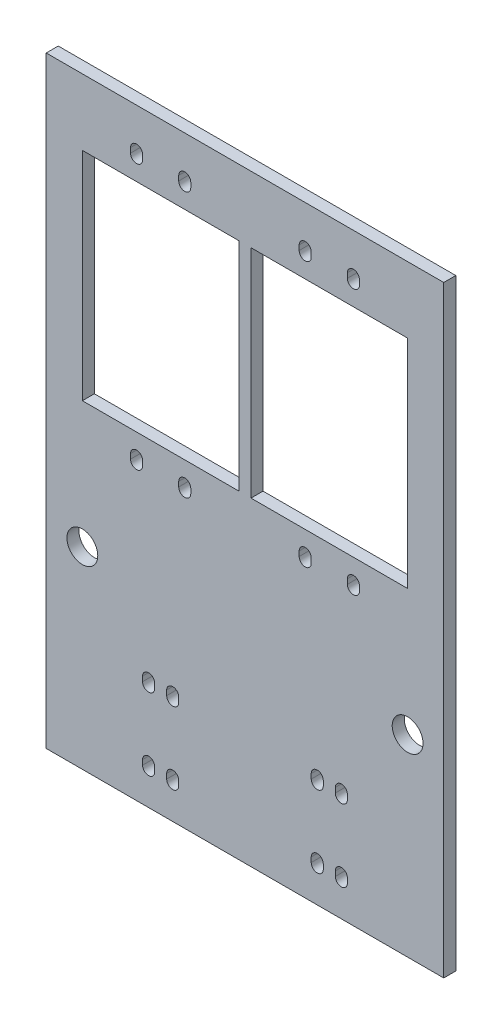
ISO-10303-21;
HEADER;
FILE_DESCRIPTION(('STEP AP214'),'2;1');
FILE_NAME('part.step','',(''),(''),'','','');
FILE_SCHEMA(('AUTOMOTIVE_DESIGN { 1 0 10303 214 1 1 1 1 }'));
ENDSEC;
DATA;
#1=APPLICATION_CONTEXT('core data for automotive mechanical design processes');
#2=APPLICATION_PROTOCOL_DEFINITION('international standard','automotive_design',2000,#1);
#3=PRODUCT_CONTEXT('',#1,'mechanical');
#4=PRODUCT('Part','Part','',(#3));
#5=PRODUCT_RELATED_PRODUCT_CATEGORY('part','',(#4));
#6=PRODUCT_DEFINITION_FORMATION('','',#4);
#7=PRODUCT_DEFINITION_CONTEXT('part definition',#1,'design');
#8=PRODUCT_DEFINITION('design','',#6,#7);
#9=PRODUCT_DEFINITION_SHAPE('','',#8);
#10=(LENGTH_UNIT() NAMED_UNIT(*) SI_UNIT(.MILLI.,.METRE.));
#11=(NAMED_UNIT(*) PLANE_ANGLE_UNIT() SI_UNIT($,.RADIAN.));
#12=(NAMED_UNIT(*) SI_UNIT($,.STERADIAN.) SOLID_ANGLE_UNIT());
#13=UNCERTAINTY_MEASURE_WITH_UNIT(LENGTH_MEASURE(1.E-05),#10,'distance_accuracy_value','');
#14=(GEOMETRIC_REPRESENTATION_CONTEXT(3) GLOBAL_UNCERTAINTY_ASSIGNED_CONTEXT((#13)) GLOBAL_UNIT_ASSIGNED_CONTEXT((#10,
#11,#12)) REPRESENTATION_CONTEXT('',''));
#15=CARTESIAN_POINT('',(0.,0.,0.));
#16=DIRECTION('',(0.,0.,1.));
#17=DIRECTION('',(1.,0.,0.));
#18=AXIS2_PLACEMENT_3D('',#15,#16,#17);
#19=CARTESIAN_POINT('',(0.,0.,6.35));
#20=DIRECTION('',(0.,0.,1.));
#21=DIRECTION('',(1.,0.,0.));
#22=AXIS2_PLACEMENT_3D('',#19,#20,#21);
#23=PLANE('',#22);
#24=DIRECTION('',(0.,1.,0.));
#25=VECTOR('',#24,1.);
#26=CARTESIAN_POINT('',(-47.625,0.,6.35));
#27=LINE('',#26,#25);
#28=CARTESIAN_POINT('',(-47.625,-102.87,6.35));
#29=VERTEX_POINT('',#28);
#30=CARTESIAN_POINT('',(-47.625,-100.33,6.35));
#31=VERTEX_POINT('',#30);
#32=EDGE_CURVE('E713',#29,#31,#27,.T.);
#33=ORIENTED_EDGE('',*,*,#32,.F.);
#34=CARTESIAN_POINT('',(-50.8,-102.87,6.35));
#35=DIRECTION('',(0.,0.,1.));
#36=DIRECTION('',(1.,0.,0.));
#37=AXIS2_PLACEMENT_3D('',#34,#35,#36);
#38=CIRCLE('',#37,3.175);
#39=CARTESIAN_POINT('',(-53.975,-102.87,6.35));
#40=VERTEX_POINT('',#39);
#41=EDGE_CURVE('E783',#40,#29,#38,.T.);
#42=ORIENTED_EDGE('',*,*,#41,.F.);
#43=DIRECTION('',(0.,1.,0.));
#44=VECTOR('',#43,1.);
#45=CARTESIAN_POINT('',(-53.975,0.,6.35));
#46=LINE('',#45,#44);
#47=CARTESIAN_POINT('',(-53.975,-100.33,6.35));
#48=VERTEX_POINT('',#47);
#49=EDGE_CURVE('E797',#40,#48,#46,.T.);
#50=ORIENTED_EDGE('',*,*,#49,.T.);
#51=CARTESIAN_POINT('',(-50.8,-100.33,6.35));
#52=DIRECTION('',(0.,0.,1.));
#53=DIRECTION('',(1.,0.,0.));
#54=AXIS2_PLACEMENT_3D('',#51,#52,#53);
#55=CIRCLE('',#54,3.175);
#56=EDGE_CURVE('E794',#31,#48,#55,.T.);
#57=ORIENTED_EDGE('',*,*,#56,.F.);
#58=EDGE_LOOP('',(#33,#42,#50,#57));
#59=FACE_BOUND('',#58,.T.);
#60=DIRECTION('',(0.,-1.,0.));
#61=VECTOR('',#60,1.);
#62=CARTESIAN_POINT('',(-41.2749999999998,0.,6.35));
#63=LINE('',#62,#61);
#64=CARTESIAN_POINT('',(-41.2749999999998,-138.43,6.35));
#65=VERTEX_POINT('',#64);
#66=CARTESIAN_POINT('',(-41.2749999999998,-140.97,6.35));
#67=VERTEX_POINT('',#66);
#68=EDGE_CURVE('E578',#65,#67,#63,.T.);
#69=ORIENTED_EDGE('',*,*,#68,.F.);
#70=CARTESIAN_POINT('',(-38.0999999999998,-138.43,6.35));
#71=DIRECTION('',(0.,0.,1.));
#72=DIRECTION('',(1.,0.,0.));
#73=AXIS2_PLACEMENT_3D('',#70,#71,#72);
#74=CIRCLE('',#73,3.175);
#75=CARTESIAN_POINT('',(-34.9249999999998,-138.43,6.35));
#76=VERTEX_POINT('',#75);
#77=EDGE_CURVE('E568',#76,#65,#74,.T.);
#78=ORIENTED_EDGE('',*,*,#77,.F.);
#79=DIRECTION('',(0.,-1.,0.));
#80=VECTOR('',#79,1.);
#81=CARTESIAN_POINT('',(-34.9249999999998,0.,6.35));
#82=LINE('',#81,#80);
#83=CARTESIAN_POINT('',(-34.9249999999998,-140.97,6.35));
#84=VERTEX_POINT('',#83);
#85=EDGE_CURVE('E584',#76,#84,#82,.T.);
#86=ORIENTED_EDGE('',*,*,#85,.T.);
#87=CARTESIAN_POINT('',(-38.0999999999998,-140.97,6.35));
#88=DIRECTION('',(0.,0.,1.));
#89=DIRECTION('',(1.,0.,0.));
#90=AXIS2_PLACEMENT_3D('',#87,#88,#89);
#91=CIRCLE('',#90,3.175);
#92=EDGE_CURVE('E580',#67,#84,#91,.T.);
#93=ORIENTED_EDGE('',*,*,#92,.F.);
#94=EDGE_LOOP('',(#69,#78,#86,#93));
#95=FACE_BOUND('',#94,.T.);
#96=DIRECTION('',(0.,-1.,0.));
#97=VECTOR('',#96,1.);
#98=CARTESIAN_POINT('',(47.6250000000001,0.,6.35));
#99=LINE('',#98,#97);
#100=CARTESIAN_POINT('',(47.6250000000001,-138.43,6.35));
#101=VERTEX_POINT('',#100);
#102=CARTESIAN_POINT('',(47.6250000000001,-140.97,6.35));
#103=VERTEX_POINT('',#102);
#104=EDGE_CURVE('E642',#101,#103,#99,.T.);
#105=ORIENTED_EDGE('',*,*,#104,.F.);
#106=CARTESIAN_POINT('',(50.8000000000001,-138.43,6.35));
#107=DIRECTION('',(0.,0.,1.));
#108=DIRECTION('',(1.,0.,0.));
#109=AXIS2_PLACEMENT_3D('',#106,#107,#108);
#110=CIRCLE('',#109,3.175);
#111=CARTESIAN_POINT('',(53.9750000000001,-138.43,6.35));
#112=VERTEX_POINT('',#111);
#113=EDGE_CURVE('E632',#112,#101,#110,.T.);
#114=ORIENTED_EDGE('',*,*,#113,.F.);
#115=DIRECTION('',(0.,-1.,0.));
#116=VECTOR('',#115,1.);
#117=CARTESIAN_POINT('',(53.9750000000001,0.,6.35));
#118=LINE('',#117,#116);
#119=CARTESIAN_POINT('',(53.9750000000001,-140.97,6.35));
#120=VERTEX_POINT('',#119);
#121=EDGE_CURVE('E648',#112,#120,#118,.T.);
#122=ORIENTED_EDGE('',*,*,#121,.T.);
#123=CARTESIAN_POINT('',(50.8000000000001,-140.97,6.35));
#124=DIRECTION('',(0.,0.,1.));
#125=DIRECTION('',(1.,0.,0.));
#126=AXIS2_PLACEMENT_3D('',#123,#124,#125);
#127=CIRCLE('',#126,3.175);
#128=EDGE_CURVE('E644',#103,#120,#127,.T.);
#129=ORIENTED_EDGE('',*,*,#128,.F.);
#130=EDGE_LOOP('',(#105,#114,#122,#129));
#131=FACE_BOUND('',#130,.T.);
#132=DIRECTION('',(0.,-1.,0.));
#133=VECTOR('',#132,1.);
#134=CARTESIAN_POINT('',(-34.9250000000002,0.,6.35));
#135=LINE('',#134,#133);
#136=CARTESIAN_POINT('',(-34.9250000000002,137.795,6.35));
#137=VERTEX_POINT('',#136);
#138=CARTESIAN_POINT('',(-34.9250000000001,135.255,6.35));
#139=VERTEX_POINT('',#138);
#140=EDGE_CURVE('E950',#137,#139,#135,.T.);
#141=ORIENTED_EDGE('',*,*,#140,.F.);
#142=CARTESIAN_POINT('',(-31.75,137.795,6.35));
#143=DIRECTION('',(0.,0.,1.));
#144=DIRECTION('',(1.,0.,0.));
#145=AXIS2_PLACEMENT_3D('',#142,#143,#144);
#146=CIRCLE('',#145,3.17500000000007);
#147=CARTESIAN_POINT('',(-28.575,137.795,6.35));
#148=VERTEX_POINT('',#147);
#149=EDGE_CURVE('E940',#148,#137,#146,.T.);
#150=ORIENTED_EDGE('',*,*,#149,.F.);
#151=DIRECTION('',(0.,-1.,0.));
#152=VECTOR('',#151,1.);
#153=CARTESIAN_POINT('',(-28.5750000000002,0.,6.35));
#154=LINE('',#153,#152);
#155=CARTESIAN_POINT('',(-28.575,135.255,6.35));
#156=VERTEX_POINT('',#155);
#157=EDGE_CURVE('E956',#148,#156,#154,.T.);
#158=ORIENTED_EDGE('',*,*,#157,.T.);
#159=CARTESIAN_POINT('',(-31.75,135.255,6.35));
#160=DIRECTION('',(0.,0.,1.));
#161=DIRECTION('',(1.,0.,0.));
#162=AXIS2_PLACEMENT_3D('',#159,#160,#161);
#163=CIRCLE('',#162,3.17500000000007);
#164=EDGE_CURVE('E952',#139,#156,#163,.T.);
#165=ORIENTED_EDGE('',*,*,#164,.F.);
#166=EDGE_LOOP('',(#141,#150,#158,#165));
#167=FACE_BOUND('',#166,.T.);
#168=DIRECTION('',(0.,1.,0.));
#169=VECTOR('',#168,1.);
#170=CARTESIAN_POINT('',(34.9250000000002,0.,6.35));
#171=LINE('',#170,#169);
#172=CARTESIAN_POINT('',(34.9250000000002,-4.44499999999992,6.35));
#173=VERTEX_POINT('',#172);
#174=CARTESIAN_POINT('',(34.925,-1.90499999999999,6.35));
#175=VERTEX_POINT('',#174);
#176=EDGE_CURVE('E772',#173,#175,#171,.T.);
#177=ORIENTED_EDGE('',*,*,#176,.F.);
#178=CARTESIAN_POINT('',(31.7500000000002,-4.44499999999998,6.35));
#179=DIRECTION('',(0.,0.,1.));
#180=DIRECTION('',(1.,0.,0.));
#181=AXIS2_PLACEMENT_3D('',#178,#179,#180);
#182=CIRCLE('',#181,3.17500000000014);
#183=CARTESIAN_POINT('',(28.5749999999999,-4.44499999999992,6.35));
#184=VERTEX_POINT('',#183);
#185=EDGE_CURVE('E846',#184,#173,#182,.T.);
#186=ORIENTED_EDGE('',*,*,#185,.F.);
#187=DIRECTION('',(0.,1.,0.));
#188=VECTOR('',#187,1.);
#189=CARTESIAN_POINT('',(28.5749999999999,0.,6.35));
#190=LINE('',#189,#188);
#191=CARTESIAN_POINT('',(28.5749999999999,-1.90499999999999,6.35));
#192=VERTEX_POINT('',#191);
#193=EDGE_CURVE('E860',#184,#192,#190,.T.);
#194=ORIENTED_EDGE('',*,*,#193,.T.);
#195=CARTESIAN_POINT('',(31.7499999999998,-1.90499999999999,6.35));
#196=DIRECTION('',(0.,0.,1.));
#197=DIRECTION('',(1.,0.,0.));
#198=AXIS2_PLACEMENT_3D('',#195,#196,#197);
#199=CIRCLE('',#198,3.17500000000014);
#200=EDGE_CURVE('E857',#175,#192,#199,.T.);
#201=ORIENTED_EDGE('',*,*,#200,.F.);
#202=EDGE_LOOP('',(#177,#186,#194,#201));
#203=FACE_BOUND('',#202,.T.);
#204=DIRECTION('',(0.,1.,0.));
#205=VECTOR('',#204,1.);
#206=CARTESIAN_POINT('',(-53.9749999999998,0.,6.35));
#207=LINE('',#206,#205);
#208=CARTESIAN_POINT('',(-53.9749999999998,-4.44499999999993,6.35));
#209=VERTEX_POINT('',#208);
#210=CARTESIAN_POINT('',(-53.9749999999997,-1.90499999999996,6.35));
#211=VERTEX_POINT('',#210);
#212=EDGE_CURVE('E835',#209,#211,#207,.T.);
#213=ORIENTED_EDGE('',*,*,#212,.F.);
#214=CARTESIAN_POINT('',(-57.1499999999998,-4.44499999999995,6.35));
#215=DIRECTION('',(0.,0.,1.));
#216=DIRECTION('',(1.,0.,0.));
#217=AXIS2_PLACEMENT_3D('',#214,#215,#216);
#218=CIRCLE('',#217,3.17500000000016);
#219=CARTESIAN_POINT('',(-60.3250000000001,-4.44499999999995,6.35));
#220=VERTEX_POINT('',#219);
#221=EDGE_CURVE('E910',#220,#209,#218,.T.);
#222=ORIENTED_EDGE('',*,*,#221,.F.);
#223=DIRECTION('',(0.,1.,0.));
#224=VECTOR('',#223,1.);
#225=CARTESIAN_POINT('',(-60.3250000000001,0.,6.35));
#226=LINE('',#225,#224);
#227=CARTESIAN_POINT('',(-60.3250000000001,-1.90499999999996,6.35));
#228=VERTEX_POINT('',#227);
#229=EDGE_CURVE('E924',#220,#228,#226,.T.);
#230=ORIENTED_EDGE('',*,*,#229,.T.);
#231=CARTESIAN_POINT('',(-57.1499999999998,-1.90499999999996,6.35));
#232=DIRECTION('',(0.,0.,1.));
#233=DIRECTION('',(1.,0.,0.));
#234=AXIS2_PLACEMENT_3D('',#231,#232,#233);
#235=CIRCLE('',#234,3.17500000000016);
#236=EDGE_CURVE('E921',#211,#228,#235,.T.);
#237=ORIENTED_EDGE('',*,*,#236,.F.);
#238=EDGE_LOOP('',(#213,#222,#230,#237));
#239=FACE_BOUND('',#238,.T.);
#240=DIRECTION('',(0.,-1.,0.));
#241=VECTOR('',#240,1.);
#242=CARTESIAN_POINT('',(53.9749999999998,0.,6.35));
#243=LINE('',#242,#241);
#244=CARTESIAN_POINT('',(53.9749999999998,137.795,6.35));
#245=VERTEX_POINT('',#244);
#246=CARTESIAN_POINT('',(53.9749999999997,135.255,6.35));
#247=VERTEX_POINT('',#246);
#248=EDGE_CURVE('E886',#245,#247,#243,.T.);
#249=ORIENTED_EDGE('',*,*,#248,.F.);
#250=CARTESIAN_POINT('',(57.1499999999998,137.795,6.35));
#251=DIRECTION('',(0.,0.,1.));
#252=DIRECTION('',(1.,0.,0.));
#253=AXIS2_PLACEMENT_3D('',#250,#251,#252);
#254=CIRCLE('',#253,3.17500000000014);
#255=CARTESIAN_POINT('',(60.3250000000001,137.795,6.35));
#256=VERTEX_POINT('',#255);
#257=EDGE_CURVE('E876',#256,#245,#254,.T.);
#258=ORIENTED_EDGE('',*,*,#257,.F.);
#259=DIRECTION('',(0.,-1.,0.));
#260=VECTOR('',#259,1.);
#261=CARTESIAN_POINT('',(60.3250000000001,0.,6.35));
#262=LINE('',#261,#260);
#263=CARTESIAN_POINT('',(60.3250000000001,135.255,6.35));
#264=VERTEX_POINT('',#263);
#265=EDGE_CURVE('E892',#256,#264,#262,.T.);
#266=ORIENTED_EDGE('',*,*,#265,.T.);
#267=CARTESIAN_POINT('',(57.1499999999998,135.255,6.35));
#268=DIRECTION('',(0.,0.,1.));
#269=DIRECTION('',(1.,0.,0.));
#270=AXIS2_PLACEMENT_3D('',#267,#268,#269);
#271=CIRCLE('',#270,3.17500000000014);
#272=EDGE_CURVE('E888',#247,#264,#271,.T.);
#273=ORIENTED_EDGE('',*,*,#272,.F.);
#274=EDGE_LOOP('',(#249,#258,#266,#273));
#275=FACE_BOUND('',#274,.T.);
#276=DIRECTION('',(0.,1.,0.));
#277=VECTOR('',#276,1.);
#278=CARTESIAN_POINT('',(41.2749999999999,0.,6.35));
#279=LINE('',#278,#277);
#280=CARTESIAN_POINT('',(41.2749999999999,-102.87,6.35));
#281=VERTEX_POINT('',#280);
#282=CARTESIAN_POINT('',(41.2749999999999,-100.33,6.35));
#283=VERTEX_POINT('',#282);
#284=EDGE_CURVE('E515',#281,#283,#279,.T.);
#285=ORIENTED_EDGE('',*,*,#284,.F.);
#286=CARTESIAN_POINT('',(38.0999999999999,-102.87,6.35));
#287=DIRECTION('',(0.,0.,1.));
#288=DIRECTION('',(1.,0.,0.));
#289=AXIS2_PLACEMENT_3D('',#286,#287,#288);
#290=CIRCLE('',#289,3.175);
#291=CARTESIAN_POINT('',(34.9249999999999,-102.87,6.35));
#292=VERTEX_POINT('',#291);
#293=EDGE_CURVE('E533',#292,#281,#290,.T.);
#294=ORIENTED_EDGE('',*,*,#293,.F.);
#295=DIRECTION('',(0.,1.,0.));
#296=VECTOR('',#295,1.);
#297=CARTESIAN_POINT('',(34.9249999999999,0.,6.35));
#298=LINE('',#297,#296);
#299=CARTESIAN_POINT('',(34.9249999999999,-100.33,6.35));
#300=VERTEX_POINT('',#299);
#301=EDGE_CURVE('E536',#292,#300,#298,.T.);
#302=ORIENTED_EDGE('',*,*,#301,.T.);
#303=CARTESIAN_POINT('',(38.0999999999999,-100.33,6.35));
#304=DIRECTION('',(0.,0.,1.));
#305=DIRECTION('',(1.,0.,0.));
#306=AXIS2_PLACEMENT_3D('',#303,#304,#305);
#307=CIRCLE('',#306,3.175);
#308=EDGE_CURVE('E542',#283,#300,#307,.T.);
#309=ORIENTED_EDGE('',*,*,#308,.F.);
#310=EDGE_LOOP('',(#285,#294,#302,#309));
#311=FACE_BOUND('',#310,.T.);
#312=CARTESIAN_POINT('',(-85.725,-57.15,6.35));
#313=DIRECTION('',(0.,0.,1.));
#314=DIRECTION('',(1.,0.,0.));
#315=AXIS2_PLACEMENT_3D('',#312,#313,#314);
#316=CIRCLE('',#315,8.128);
#317=CARTESIAN_POINT('',(-77.597,-57.15,6.35));
#318=VERTEX_POINT('',#317);
#319=EDGE_CURVE('E555',#318,#318,#316,.T.);
#320=ORIENTED_EDGE('',*,*,#319,.F.);
#321=EDGE_LOOP('',(#320));
#322=FACE_BOUND('',#321,.T.);
#323=DIRECTION('',(1.,0.,0.));
#324=VECTOR('',#323,1.);
#325=CARTESIAN_POINT('',(0.,123.825,6.35));
#326=LINE('',#325,#324);
#327=CARTESIAN_POINT('',(-85.7250000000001,123.825,6.35));
#328=VERTEX_POINT('',#327);
#329=CARTESIAN_POINT('',(-3.17500000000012,123.825,6.35));
#330=VERTEX_POINT('',#329);
#331=EDGE_CURVE('E1076',#328,#330,#326,.T.);
#332=ORIENTED_EDGE('',*,*,#331,.T.);
#333=DIRECTION('',(0.,-1.,0.));
#334=VECTOR('',#333,1.);
#335=CARTESIAN_POINT('',(-3.17500000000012,0.,6.35));
#336=LINE('',#335,#334);
#337=CARTESIAN_POINT('',(-3.17500000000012,9.525,6.35));
#338=VERTEX_POINT('',#337);
#339=EDGE_CURVE('E1026',#330,#338,#336,.T.);
#340=ORIENTED_EDGE('',*,*,#339,.T.);
#341=DIRECTION('',(1.,0.,0.));
#342=VECTOR('',#341,1.);
#343=CARTESIAN_POINT('',(0.,9.525,6.35));
#344=LINE('',#343,#342);
#345=CARTESIAN_POINT('',(-85.7250000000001,9.52500000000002,6.35));
#346=VERTEX_POINT('',#345);
#347=EDGE_CURVE('E1065',#346,#338,#344,.T.);
#348=ORIENTED_EDGE('',*,*,#347,.F.);
#349=DIRECTION('',(0.,1.,0.));
#350=VECTOR('',#349,1.);
#351=CARTESIAN_POINT('',(-85.7250000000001,0.,6.35));
#352=LINE('',#351,#350);
#353=EDGE_CURVE('E1079',#346,#328,#352,.T.);
#354=ORIENTED_EDGE('',*,*,#353,.T.);
#355=EDGE_LOOP('',(#332,#340,#348,#354));
#356=FACE_BOUND('',#355,.T.);
#357=DIRECTION('',(0.,1.,0.));
#358=VECTOR('',#357,1.);
#359=CARTESIAN_POINT('',(104.775,158.75,6.35));
#360=LINE('',#359,#358);
#361=CARTESIAN_POINT('',(104.775,-158.75,6.35));
#362=VERTEX_POINT('',#361);
#363=CARTESIAN_POINT('',(104.775,158.75,6.35));
#364=VERTEX_POINT('',#363);
#365=EDGE_CURVE('E1093',#362,#364,#360,.T.);
#366=ORIENTED_EDGE('',*,*,#365,.T.);
#367=DIRECTION('',(-1.,0.,0.));
#368=VECTOR('',#367,1.);
#369=CARTESIAN_POINT('',(-104.775,158.75,6.35));
#370=LINE('',#369,#368);
#371=CARTESIAN_POINT('',(-104.775,158.75,6.35));
#372=VERTEX_POINT('',#371);
#373=EDGE_CURVE('E1096',#364,#372,#370,.T.);
#374=ORIENTED_EDGE('',*,*,#373,.T.);
#375=DIRECTION('',(0.,-1.,0.));
#376=VECTOR('',#375,1.);
#377=CARTESIAN_POINT('',(-104.775,158.75,6.35));
#378=LINE('',#377,#376);
#379=CARTESIAN_POINT('',(-104.775,-158.75,6.35));
#380=VERTEX_POINT('',#379);
#381=EDGE_CURVE('E1099',#372,#380,#378,.T.);
#382=ORIENTED_EDGE('',*,*,#381,.T.);
#383=DIRECTION('',(1.,0.,0.));
#384=VECTOR('',#383,1.);
#385=CARTESIAN_POINT('',(-104.775,-158.75,6.35));
#386=LINE('',#385,#384);
#387=EDGE_CURVE('E1101',#380,#362,#386,.T.);
#388=ORIENTED_EDGE('',*,*,#387,.T.);
#389=EDGE_LOOP('',(#366,#374,#382,#388));
#390=FACE_BOUND('',#389,.T.);
#391=CARTESIAN_POINT('',(85.7250000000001,-57.15,6.35));
#392=DIRECTION('',(0.,0.,1.));
#393=DIRECTION('',(1.,0.,0.));
#394=AXIS2_PLACEMENT_3D('',#391,#392,#393);
#395=CIRCLE('',#394,8.128);
#396=CARTESIAN_POINT('',(93.8530000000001,-57.15,6.35));
#397=VERTEX_POINT('',#396);
#398=EDGE_CURVE('E561',#397,#397,#395,.F.);
#399=ORIENTED_EDGE('',*,*,#398,.T.);
#400=EDGE_LOOP('',(#399));
#401=FACE_BOUND('',#400,.T.);
#402=DIRECTION('',(0.,1.,0.));
#403=VECTOR('',#402,1.);
#404=CARTESIAN_POINT('',(-34.9250000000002,0.,6.35));
#405=LINE('',#404,#403);
#406=CARTESIAN_POINT('',(-34.9250000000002,-4.44499999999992,6.35));
#407=VERTEX_POINT('',#406);
#408=CARTESIAN_POINT('',(-34.9250000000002,-1.90499999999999,6.35));
#409=VERTEX_POINT('',#408);
#410=EDGE_CURVE('E824',#407,#409,#405,.T.);
#411=ORIENTED_EDGE('',*,*,#410,.T.);
#412=CARTESIAN_POINT('',(-31.75,-1.90499999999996,6.35));
#413=DIRECTION('',(0.,0.,1.));
#414=DIRECTION('',(1.,0.,0.));
#415=AXIS2_PLACEMENT_3D('',#412,#413,#414);
#416=CIRCLE('',#415,3.17500000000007);
#417=CARTESIAN_POINT('',(-28.575,-1.90499999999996,6.35));
#418=VERTEX_POINT('',#417);
#419=EDGE_CURVE('E821',#409,#418,#416,.F.);
#420=ORIENTED_EDGE('',*,*,#419,.T.);
#421=DIRECTION('',(0.,1.,0.));
#422=VECTOR('',#421,1.);
#423=CARTESIAN_POINT('',(-28.575,0.,6.35));
#424=LINE('',#423,#422);
#425=CARTESIAN_POINT('',(-28.575,-4.44499999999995,6.35));
#426=VERTEX_POINT('',#425);
#427=EDGE_CURVE('E812',#426,#418,#424,.T.);
#428=ORIENTED_EDGE('',*,*,#427,.F.);
#429=CARTESIAN_POINT('',(-31.75,-4.44499999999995,6.35));
#430=DIRECTION('',(0.,0.,1.));
#431=DIRECTION('',(1.,0.,0.));
#432=AXIS2_PLACEMENT_3D('',#429,#430,#431);
#433=CIRCLE('',#432,3.17500000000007);
#434=EDGE_CURVE('E828',#426,#407,#433,.F.);
#435=ORIENTED_EDGE('',*,*,#434,.T.);
#436=EDGE_LOOP('',(#411,#420,#428,#435));
#437=FACE_BOUND('',#436,.T.);
#438=DIRECTION('',(0.,1.,0.));
#439=VECTOR('',#438,1.);
#440=CARTESIAN_POINT('',(85.7250000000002,0.,6.35));
#441=LINE('',#440,#439);
#442=CARTESIAN_POINT('',(85.7250000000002,9.52500000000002,6.35));
#443=VERTEX_POINT('',#442);
#444=CARTESIAN_POINT('',(85.7250000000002,123.825,6.35));
#445=VERTEX_POINT('',#444);
#446=EDGE_CURVE('E1015',#443,#445,#441,.T.);
#447=ORIENTED_EDGE('',*,*,#446,.F.);
#448=DIRECTION('',(-1.,0.,0.));
#449=VECTOR('',#448,1.);
#450=CARTESIAN_POINT('',(0.,9.525,6.35));
#451=LINE('',#450,#449);
#452=CARTESIAN_POINT('',(3.17500000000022,9.525,6.35));
#453=VERTEX_POINT('',#452);
#454=EDGE_CURVE('E1012',#443,#453,#451,.T.);
#455=ORIENTED_EDGE('',*,*,#454,.T.);
#456=DIRECTION('',(0.,-1.,0.));
#457=VECTOR('',#456,1.);
#458=CARTESIAN_POINT('',(3.17500000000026,0.,6.35));
#459=LINE('',#458,#457);
#460=CARTESIAN_POINT('',(3.17499999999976,123.825,6.35));
#461=VERTEX_POINT('',#460);
#462=EDGE_CURVE('E1002',#461,#453,#459,.T.);
#463=ORIENTED_EDGE('',*,*,#462,.F.);
#464=DIRECTION('',(-1.,0.,0.));
#465=VECTOR('',#464,1.);
#466=CARTESIAN_POINT('',(0.,123.825,6.35));
#467=LINE('',#466,#465);
#468=EDGE_CURVE('E1019',#445,#461,#467,.T.);
#469=ORIENTED_EDGE('',*,*,#468,.F.);
#470=EDGE_LOOP('',(#447,#455,#463,#469));
#471=FACE_BOUND('',#470,.T.);
#472=DIRECTION('',(0.,-1.,0.));
#473=VECTOR('',#472,1.);
#474=CARTESIAN_POINT('',(-53.9749999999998,0.,6.35));
#475=LINE('',#474,#473);
#476=CARTESIAN_POINT('',(-53.9749999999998,137.795,6.35));
#477=VERTEX_POINT('',#476);
#478=CARTESIAN_POINT('',(-53.9749999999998,135.255,6.35));
#479=VERTEX_POINT('',#478);
#480=EDGE_CURVE('E1047',#477,#479,#475,.T.);
#481=ORIENTED_EDGE('',*,*,#480,.T.);
#482=CARTESIAN_POINT('',(-57.1499999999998,135.255,6.35));
#483=DIRECTION('',(0.,0.,1.));
#484=DIRECTION('',(1.,0.,0.));
#485=AXIS2_PLACEMENT_3D('',#482,#483,#484);
#486=CIRCLE('',#485,3.17500000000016);
#487=CARTESIAN_POINT('',(-60.3250000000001,135.255,6.35));
#488=VERTEX_POINT('',#487);
#489=EDGE_CURVE('E963',#479,#488,#486,.F.);
#490=ORIENTED_EDGE('',*,*,#489,.T.);
#491=DIRECTION('',(0.,-1.,0.));
#492=VECTOR('',#491,1.);
#493=CARTESIAN_POINT('',(-60.3250000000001,0.,6.35));
#494=LINE('',#493,#492);
#495=CARTESIAN_POINT('',(-60.3250000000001,137.795,6.35));
#496=VERTEX_POINT('',#495);
#497=EDGE_CURVE('E1036',#496,#488,#494,.T.);
#498=ORIENTED_EDGE('',*,*,#497,.F.);
#499=CARTESIAN_POINT('',(-57.1499999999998,137.795,6.35));
#500=DIRECTION('',(0.,0.,1.));
#501=DIRECTION('',(1.,0.,0.));
#502=AXIS2_PLACEMENT_3D('',#499,#500,#501);
#503=CIRCLE('',#502,3.17500000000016);
#504=EDGE_CURVE('E1050',#496,#477,#503,.F.);
#505=ORIENTED_EDGE('',*,*,#504,.T.);
#506=EDGE_LOOP('',(#481,#490,#498,#505));
#507=FACE_BOUND('',#506,.T.);
#508=DIRECTION('',(0.,-1.,0.));
#509=VECTOR('',#508,1.);
#510=CARTESIAN_POINT('',(34.9250000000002,0.,6.35));
#511=LINE('',#510,#509);
#512=CARTESIAN_POINT('',(34.9250000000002,137.795,6.35));
#513=VERTEX_POINT('',#512);
#514=CARTESIAN_POINT('',(34.9250000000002,135.255,6.35));
#515=VERTEX_POINT('',#514);
#516=EDGE_CURVE('E984',#513,#515,#511,.T.);
#517=ORIENTED_EDGE('',*,*,#516,.T.);
#518=CARTESIAN_POINT('',(31.7499999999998,135.255,6.35));
#519=DIRECTION('',(0.,0.,1.));
#520=DIRECTION('',(1.,0.,0.));
#521=AXIS2_PLACEMENT_3D('',#518,#519,#520);
#522=CIRCLE('',#521,3.17500000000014);
#523=CARTESIAN_POINT('',(28.5749999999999,135.255,6.35));
#524=VERTEX_POINT('',#523);
#525=EDGE_CURVE('E899',#515,#524,#522,.F.);
#526=ORIENTED_EDGE('',*,*,#525,.T.);
#527=DIRECTION('',(0.,-1.,0.));
#528=VECTOR('',#527,1.);
#529=CARTESIAN_POINT('',(28.5749999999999,0.,6.35));
#530=LINE('',#529,#528);
#531=CARTESIAN_POINT('',(28.5749999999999,137.795,6.35));
#532=VERTEX_POINT('',#531);
#533=EDGE_CURVE('E973',#532,#524,#530,.T.);
#534=ORIENTED_EDGE('',*,*,#533,.F.);
#535=CARTESIAN_POINT('',(31.7500000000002,137.795,6.35));
#536=DIRECTION('',(0.,0.,1.));
#537=DIRECTION('',(1.,0.,0.));
#538=AXIS2_PLACEMENT_3D('',#535,#536,#537);
#539=CIRCLE('',#538,3.17500000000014);
#540=EDGE_CURVE('E987',#532,#513,#539,.F.);
#541=ORIENTED_EDGE('',*,*,#540,.T.);
#542=EDGE_LOOP('',(#517,#526,#534,#541));
#543=FACE_BOUND('',#542,.T.);
#544=DIRECTION('',(0.,1.,0.));
#545=VECTOR('',#544,1.);
#546=CARTESIAN_POINT('',(47.6250000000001,0.,6.35));
#547=LINE('',#546,#545);
#548=CARTESIAN_POINT('',(47.6250000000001,-102.87,6.35));
#549=VERTEX_POINT('',#548);
#550=CARTESIAN_POINT('',(47.6250000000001,-100.33,6.35));
#551=VERTEX_POINT('',#550);
#552=EDGE_CURVE('E674',#549,#551,#547,.T.);
#553=ORIENTED_EDGE('',*,*,#552,.T.);
#554=CARTESIAN_POINT('',(50.8000000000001,-100.33,6.35));
#555=DIRECTION('',(0.,0.,1.));
#556=DIRECTION('',(1.,0.,0.));
#557=AXIS2_PLACEMENT_3D('',#554,#555,#556);
#558=CIRCLE('',#557,3.175);
#559=CARTESIAN_POINT('',(53.9750000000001,-100.33,6.35));
#560=VERTEX_POINT('',#559);
#561=EDGE_CURVE('E549',#551,#560,#558,.F.);
#562=ORIENTED_EDGE('',*,*,#561,.T.);
#563=DIRECTION('',(0.,1.,0.));
#564=VECTOR('',#563,1.);
#565=CARTESIAN_POINT('',(53.9750000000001,0.,6.35));
#566=LINE('',#565,#564);
#567=CARTESIAN_POINT('',(53.9750000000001,-102.87,6.35));
#568=VERTEX_POINT('',#567);
#569=EDGE_CURVE('E663',#568,#560,#566,.T.);
#570=ORIENTED_EDGE('',*,*,#569,.F.);
#571=CARTESIAN_POINT('',(50.8000000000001,-102.87,6.35));
#572=DIRECTION('',(0.,0.,1.));
#573=DIRECTION('',(1.,0.,0.));
#574=AXIS2_PLACEMENT_3D('',#571,#572,#573);
#575=CIRCLE('',#574,3.175);
#576=EDGE_CURVE('E677',#568,#549,#575,.F.);
#577=ORIENTED_EDGE('',*,*,#576,.T.);
#578=EDGE_LOOP('',(#553,#562,#570,#577));
#579=FACE_BOUND('',#578,.T.);
#580=CARTESIAN_POINT('',(38.0999999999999,-138.43,6.35));
#581=DIRECTION('',(0.,0.,1.));
#582=DIRECTION('',(1.,0.,0.));
#583=AXIS2_PLACEMENT_3D('',#580,#581,#582);
#584=CIRCLE('',#583,3.175);
#585=CARTESIAN_POINT('',(34.9249999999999,-138.43,6.35));
#586=VERTEX_POINT('',#585);
#587=CARTESIAN_POINT('',(41.2749999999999,-138.43,6.35));
#588=VERTEX_POINT('',#587);
#589=EDGE_CURVE('E611',#586,#588,#584,.F.);
#590=ORIENTED_EDGE('',*,*,#589,.T.);
#591=DIRECTION('',(0.,-1.,0.));
#592=VECTOR('',#591,1.);
#593=CARTESIAN_POINT('',(41.2749999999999,0.,6.35));
#594=LINE('',#593,#592);
#595=CARTESIAN_POINT('',(41.2749999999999,-140.97,6.35));
#596=VERTEX_POINT('',#595);
#597=EDGE_CURVE('E608',#588,#596,#594,.T.);
#598=ORIENTED_EDGE('',*,*,#597,.T.);
#599=CARTESIAN_POINT('',(38.0999999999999,-140.97,6.35));
#600=DIRECTION('',(0.,0.,1.));
#601=DIRECTION('',(1.,0.,0.));
#602=AXIS2_PLACEMENT_3D('',#599,#600,#601);
#603=CIRCLE('',#602,3.175);
#604=CARTESIAN_POINT('',(34.9249999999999,-140.97,6.35));
#605=VERTEX_POINT('',#604);
#606=EDGE_CURVE('E600',#596,#605,#603,.F.);
#607=ORIENTED_EDGE('',*,*,#606,.T.);
#608=DIRECTION('',(0.,-1.,0.));
#609=VECTOR('',#608,1.);
#610=CARTESIAN_POINT('',(34.9249999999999,0.,6.35));
#611=LINE('',#610,#609);
#612=EDGE_CURVE('E615',#586,#605,#611,.T.);
#613=ORIENTED_EDGE('',*,*,#612,.F.);
#614=EDGE_LOOP('',(#590,#598,#607,#613));
#615=FACE_BOUND('',#614,.T.);
#616=DIRECTION('',(0.,1.,0.));
#617=VECTOR('',#616,1.);
#618=CARTESIAN_POINT('',(53.9749999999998,0.,6.35));
#619=LINE('',#618,#617);
#620=CARTESIAN_POINT('',(53.9749999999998,-4.44499999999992,6.35));
#621=VERTEX_POINT('',#620);
#622=CARTESIAN_POINT('',(53.9749999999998,-1.90499999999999,6.35));
#623=VERTEX_POINT('',#622);
#624=EDGE_CURVE('E761',#621,#623,#619,.T.);
#625=ORIENTED_EDGE('',*,*,#624,.T.);
#626=CARTESIAN_POINT('',(57.1500000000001,-1.90499999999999,6.35));
#627=DIRECTION('',(0.,0.,1.));
#628=DIRECTION('',(1.,0.,0.));
#629=AXIS2_PLACEMENT_3D('',#626,#627,#628);
#630=CIRCLE('',#629,3.17500000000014);
#631=CARTESIAN_POINT('',(60.3250000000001,-1.90499999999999,6.35));
#632=VERTEX_POINT('',#631);
#633=EDGE_CURVE('E758',#623,#632,#630,.F.);
#634=ORIENTED_EDGE('',*,*,#633,.T.);
#635=DIRECTION('',(0.,1.,0.));
#636=VECTOR('',#635,1.);
#637=CARTESIAN_POINT('',(60.3250000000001,0.,6.35));
#638=LINE('',#637,#636);
#639=CARTESIAN_POINT('',(60.3250000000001,-4.44499999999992,6.35));
#640=VERTEX_POINT('',#639);
#641=EDGE_CURVE('E749',#640,#632,#638,.T.);
#642=ORIENTED_EDGE('',*,*,#641,.F.);
#643=CARTESIAN_POINT('',(57.1499999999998,-4.44499999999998,6.35));
#644=DIRECTION('',(0.,0.,1.));
#645=DIRECTION('',(1.,0.,0.));
#646=AXIS2_PLACEMENT_3D('',#643,#644,#645);
#647=CIRCLE('',#646,3.17500000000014);
#648=EDGE_CURVE('E765',#640,#621,#647,.F.);
#649=ORIENTED_EDGE('',*,*,#648,.T.);
#650=EDGE_LOOP('',(#625,#634,#642,#649));
#651=FACE_BOUND('',#650,.T.);
#652=DIRECTION('',(0.,1.,0.));
#653=VECTOR('',#652,1.);
#654=CARTESIAN_POINT('',(-41.2749999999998,0.,6.35));
#655=LINE('',#654,#653);
#656=CARTESIAN_POINT('',(-41.2749999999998,-102.87,6.35));
#657=VERTEX_POINT('',#656);
#658=CARTESIAN_POINT('',(-41.2749999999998,-100.33,6.35));
#659=VERTEX_POINT('',#658);
#660=EDGE_CURVE('E702',#657,#659,#655,.T.);
#661=ORIENTED_EDGE('',*,*,#660,.T.);
#662=CARTESIAN_POINT('',(-38.0999999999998,-100.33,6.35));
#663=DIRECTION('',(0.,0.,1.));
#664=DIRECTION('',(1.,0.,0.));
#665=AXIS2_PLACEMENT_3D('',#662,#663,#664);
#666=CIRCLE('',#665,3.175);
#667=CARTESIAN_POINT('',(-34.9249999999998,-100.33,6.35));
#668=VERTEX_POINT('',#667);
#669=EDGE_CURVE('E56',#659,#668,#666,.F.);
#670=ORIENTED_EDGE('',*,*,#669,.T.);
#671=DIRECTION('',(0.,1.,0.));
#672=VECTOR('',#671,1.);
#673=CARTESIAN_POINT('',(-34.9249999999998,0.,6.35));
#674=LINE('',#673,#672);
#675=CARTESIAN_POINT('',(-34.9249999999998,-102.87,6.35));
#676=VERTEX_POINT('',#675);
#677=EDGE_CURVE('E692',#676,#668,#674,.T.);
#678=ORIENTED_EDGE('',*,*,#677,.F.);
#679=CARTESIAN_POINT('',(-38.0999999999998,-102.87,6.35));
#680=DIRECTION('',(0.,0.,1.));
#681=DIRECTION('',(1.,0.,0.));
#682=AXIS2_PLACEMENT_3D('',#679,#680,#681);
#683=CIRCLE('',#682,3.175);
#684=EDGE_CURVE('E706',#676,#657,#683,.F.);
#685=ORIENTED_EDGE('',*,*,#684,.T.);
#686=EDGE_LOOP('',(#661,#670,#678,#685));
#687=FACE_BOUND('',#686,.T.);
#688=DIRECTION('',(0.,-1.,0.));
#689=VECTOR('',#688,1.);
#690=CARTESIAN_POINT('',(-47.625,0.,6.35));
#691=LINE('',#690,#689);
#692=CARTESIAN_POINT('',(-47.625,-138.43,6.35));
#693=VERTEX_POINT('',#692);
#694=CARTESIAN_POINT('',(-47.625,-140.97,6.35));
#695=VERTEX_POINT('',#694);
#696=EDGE_CURVE('E732',#693,#695,#691,.T.);
#697=ORIENTED_EDGE('',*,*,#696,.T.);
#698=CARTESIAN_POINT('',(-50.8,-140.97,6.35));
#699=DIRECTION('',(0.,0.,1.));
#700=DIRECTION('',(1.,0.,0.));
#701=AXIS2_PLACEMENT_3D('',#698,#699,#700);
#702=CIRCLE('',#701,3.175);
#703=CARTESIAN_POINT('',(-53.975,-140.97,6.35));
#704=VERTEX_POINT('',#703);
#705=EDGE_CURVE('E48',#695,#704,#702,.F.);
#706=ORIENTED_EDGE('',*,*,#705,.T.);
#707=DIRECTION('',(0.,-1.,0.));
#708=VECTOR('',#707,1.);
#709=CARTESIAN_POINT('',(-53.975,0.,6.35));
#710=LINE('',#709,#708);
#711=CARTESIAN_POINT('',(-53.975,-138.43,6.35));
#712=VERTEX_POINT('',#711);
#713=EDGE_CURVE('E722',#712,#704,#710,.T.);
#714=ORIENTED_EDGE('',*,*,#713,.F.);
#715=CARTESIAN_POINT('',(-50.8,-138.43,6.35));
#716=DIRECTION('',(0.,0.,1.));
#717=DIRECTION('',(1.,0.,0.));
#718=AXIS2_PLACEMENT_3D('',#715,#716,#717);
#719=CIRCLE('',#718,3.175);
#720=EDGE_CURVE('E735',#712,#693,#719,.F.);
#721=ORIENTED_EDGE('',*,*,#720,.T.);
#722=EDGE_LOOP('',(#697,#706,#714,#721));
#723=FACE_BOUND('',#722,.T.);
#724=ADVANCED_FACE('F33',(#59,#95,#131,#167,#203,#239,#275,#311,#322,#356,#390,#401,#437,#471,
#507,#543,#579,#615,#651,#687,#723),#23,.T.);
#725=CARTESIAN_POINT('',(0.,0.,0.));
#726=DIRECTION('',(0.,0.,1.));
#727=DIRECTION('',(1.,0.,0.));
#728=AXIS2_PLACEMENT_3D('',#725,#726,#727);
#729=PLANE('',#728);
#730=CARTESIAN_POINT('',(-38.0999999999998,-100.33,0.));
#731=DIRECTION('',(0.,0.,1.));
#732=DIRECTION('',(1.,0.,0.));
#733=AXIS2_PLACEMENT_3D('',#730,#731,#732);
#734=CIRCLE('',#733,3.175);
#735=CARTESIAN_POINT('',(-41.2749999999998,-100.33,0.));
#736=VERTEX_POINT('',#735);
#737=CARTESIAN_POINT('',(-34.9249999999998,-100.33,0.));
#738=VERTEX_POINT('',#737);
#739=EDGE_CURVE('E689',#736,#738,#734,.F.);
#740=ORIENTED_EDGE('',*,*,#739,.F.);
#741=DIRECTION('',(0.,1.,0.));
#742=VECTOR('',#741,1.);
#743=CARTESIAN_POINT('',(-41.2749999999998,0.,0.));
#744=LINE('',#743,#742);
#745=CARTESIAN_POINT('',(-41.2749999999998,-102.87,0.));
#746=VERTEX_POINT('',#745);
#747=EDGE_CURVE('E691',#746,#736,#744,.T.);
#748=ORIENTED_EDGE('',*,*,#747,.F.);
#749=CARTESIAN_POINT('',(-38.0999999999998,-102.87,0.));
#750=DIRECTION('',(0.,0.,1.));
#751=DIRECTION('',(1.,0.,0.));
#752=AXIS2_PLACEMENT_3D('',#749,#750,#751);
#753=CIRCLE('',#752,3.175);
#754=CARTESIAN_POINT('',(-34.9249999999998,-102.87,0.));
#755=VERTEX_POINT('',#754);
#756=EDGE_CURVE('E694',#755,#746,#753,.F.);
#757=ORIENTED_EDGE('',*,*,#756,.F.);
#758=DIRECTION('',(0.,1.,0.));
#759=VECTOR('',#758,1.);
#760=CARTESIAN_POINT('',(-34.9249999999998,0.,0.));
#761=LINE('',#760,#759);
#762=EDGE_CURVE('E697',#755,#738,#761,.T.);
#763=ORIENTED_EDGE('',*,*,#762,.T.);
#764=EDGE_LOOP('',(#740,#748,#757,#763));
#765=FACE_BOUND('',#764,.T.);
#766=CARTESIAN_POINT('',(-50.8,-102.87,0.));
#767=DIRECTION('',(0.,0.,1.));
#768=DIRECTION('',(1.,0.,0.));
#769=AXIS2_PLACEMENT_3D('',#766,#767,#768);
#770=CIRCLE('',#769,3.175);
#771=CARTESIAN_POINT('',(-53.975,-102.87,0.));
#772=VERTEX_POINT('',#771);
#773=CARTESIAN_POINT('',(-47.625,-102.87,0.));
#774=VERTEX_POINT('',#773);
#775=EDGE_CURVE('E789',#772,#774,#770,.T.);
#776=ORIENTED_EDGE('',*,*,#775,.T.);
#777=DIRECTION('',(0.,1.,0.));
#778=VECTOR('',#777,1.);
#779=CARTESIAN_POINT('',(-47.625,0.,0.));
#780=LINE('',#779,#778);
#781=CARTESIAN_POINT('',(-47.625,-100.33,0.));
#782=VERTEX_POINT('',#781);
#783=EDGE_CURVE('E779',#774,#782,#780,.T.);
#784=ORIENTED_EDGE('',*,*,#783,.T.);
#785=CARTESIAN_POINT('',(-50.8,-100.33,0.));
#786=DIRECTION('',(0.,0.,1.));
#787=DIRECTION('',(1.,0.,0.));
#788=AXIS2_PLACEMENT_3D('',#785,#786,#787);
#789=CIRCLE('',#788,3.175);
#790=CARTESIAN_POINT('',(-53.975,-100.33,0.));
#791=VERTEX_POINT('',#790);
#792=EDGE_CURVE('E782',#782,#791,#789,.T.);
#793=ORIENTED_EDGE('',*,*,#792,.T.);
#794=DIRECTION('',(0.,1.,0.));
#795=VECTOR('',#794,1.);
#796=CARTESIAN_POINT('',(-53.975,0.,0.));
#797=LINE('',#796,#795);
#798=EDGE_CURVE('E786',#772,#791,#797,.T.);
#799=ORIENTED_EDGE('',*,*,#798,.F.);
#800=EDGE_LOOP('',(#776,#784,#793,#799));
#801=FACE_BOUND('',#800,.T.);
#802=DIRECTION('',(0.,-1.,0.));
#803=VECTOR('',#802,1.);
#804=CARTESIAN_POINT('',(41.2749999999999,0.,0.));
#805=LINE('',#804,#803);
#806=CARTESIAN_POINT('',(41.2749999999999,-138.43,0.));
#807=VERTEX_POINT('',#806);
#808=CARTESIAN_POINT('',(41.2749999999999,-140.97,0.));
#809=VERTEX_POINT('',#808);
#810=EDGE_CURVE('E597',#807,#809,#805,.T.);
#811=ORIENTED_EDGE('',*,*,#810,.F.);
#812=CARTESIAN_POINT('',(38.0999999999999,-138.43,0.));
#813=DIRECTION('',(0.,0.,1.));
#814=DIRECTION('',(1.,0.,0.));
#815=AXIS2_PLACEMENT_3D('',#812,#813,#814);
#816=CIRCLE('',#815,3.175);
#817=CARTESIAN_POINT('',(34.9249999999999,-138.43,0.));
#818=VERTEX_POINT('',#817);
#819=EDGE_CURVE('E599',#818,#807,#816,.F.);
#820=ORIENTED_EDGE('',*,*,#819,.F.);
#821=DIRECTION('',(0.,-1.,0.));
#822=VECTOR('',#821,1.);
#823=CARTESIAN_POINT('',(34.9249999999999,0.,0.));
#824=LINE('',#823,#822);
#825=CARTESIAN_POINT('',(34.9249999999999,-140.97,0.));
#826=VERTEX_POINT('',#825);
#827=EDGE_CURVE('E602',#818,#826,#824,.T.);
#828=ORIENTED_EDGE('',*,*,#827,.T.);
#829=CARTESIAN_POINT('',(38.0999999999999,-140.97,0.));
#830=DIRECTION('',(0.,0.,1.));
#831=DIRECTION('',(1.,0.,0.));
#832=AXIS2_PLACEMENT_3D('',#829,#830,#831);
#833=CIRCLE('',#832,3.175);
#834=EDGE_CURVE('E605',#809,#826,#833,.F.);
#835=ORIENTED_EDGE('',*,*,#834,.F.);
#836=EDGE_LOOP('',(#811,#820,#828,#835));
#837=FACE_BOUND('',#836,.T.);
#838=CARTESIAN_POINT('',(50.8000000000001,-138.43,0.));
#839=DIRECTION('',(0.,0.,1.));
#840=DIRECTION('',(1.,0.,0.));
#841=AXIS2_PLACEMENT_3D('',#838,#839,#840);
#842=CIRCLE('',#841,3.175);
#843=CARTESIAN_POINT('',(53.9750000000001,-138.43,0.));
#844=VERTEX_POINT('',#843);
#845=CARTESIAN_POINT('',(47.6250000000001,-138.43,0.));
#846=VERTEX_POINT('',#845);
#847=EDGE_CURVE('E638',#844,#846,#842,.T.);
#848=ORIENTED_EDGE('',*,*,#847,.T.);
#849=DIRECTION('',(0.,-1.,0.));
#850=VECTOR('',#849,1.);
#851=CARTESIAN_POINT('',(47.6250000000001,0.,0.));
#852=LINE('',#851,#850);
#853=CARTESIAN_POINT('',(47.6250000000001,-140.97,0.));
#854=VERTEX_POINT('',#853);
#855=EDGE_CURVE('E628',#846,#854,#852,.T.);
#856=ORIENTED_EDGE('',*,*,#855,.T.);
#857=CARTESIAN_POINT('',(50.8000000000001,-140.97,0.));
#858=DIRECTION('',(0.,0.,1.));
#859=DIRECTION('',(1.,0.,0.));
#860=AXIS2_PLACEMENT_3D('',#857,#858,#859);
#861=CIRCLE('',#860,3.175);
#862=CARTESIAN_POINT('',(53.9750000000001,-140.97,0.));
#863=VERTEX_POINT('',#862);
#864=EDGE_CURVE('E631',#854,#863,#861,.T.);
#865=ORIENTED_EDGE('',*,*,#864,.T.);
#866=DIRECTION('',(0.,-1.,0.));
#867=VECTOR('',#866,1.);
#868=CARTESIAN_POINT('',(53.9750000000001,0.,0.));
#869=LINE('',#868,#867);
#870=EDGE_CURVE('E635',#844,#863,#869,.T.);
#871=ORIENTED_EDGE('',*,*,#870,.F.);
#872=EDGE_LOOP('',(#848,#856,#865,#871));
#873=FACE_BOUND('',#872,.T.);
#874=CARTESIAN_POINT('',(31.7499999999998,135.255,0.));
#875=DIRECTION('',(0.,0.,1.));
#876=DIRECTION('',(1.,0.,0.));
#877=AXIS2_PLACEMENT_3D('',#874,#875,#876);
#878=CIRCLE('',#877,3.17500000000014);
#879=CARTESIAN_POINT('',(34.9250000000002,135.255,0.));
#880=VERTEX_POINT('',#879);
#881=CARTESIAN_POINT('',(28.5749999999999,135.255,0.));
#882=VERTEX_POINT('',#881);
#883=EDGE_CURVE('E970',#880,#882,#878,.F.);
#884=ORIENTED_EDGE('',*,*,#883,.F.);
#885=DIRECTION('',(0.,-1.,0.));
#886=VECTOR('',#885,1.);
#887=CARTESIAN_POINT('',(34.9250000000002,0.,0.));
#888=LINE('',#887,#886);
#889=CARTESIAN_POINT('',(34.9250000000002,137.795,0.));
#890=VERTEX_POINT('',#889);
#891=EDGE_CURVE('E972',#890,#880,#888,.T.);
#892=ORIENTED_EDGE('',*,*,#891,.F.);
#893=CARTESIAN_POINT('',(31.7500000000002,137.795,0.));
#894=DIRECTION('',(0.,0.,1.));
#895=DIRECTION('',(1.,0.,0.));
#896=AXIS2_PLACEMENT_3D('',#893,#894,#895);
#897=CIRCLE('',#896,3.17500000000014);
#898=CARTESIAN_POINT('',(28.5749999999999,137.795,0.));
#899=VERTEX_POINT('',#898);
#900=EDGE_CURVE('E975',#899,#890,#897,.F.);
#901=ORIENTED_EDGE('',*,*,#900,.F.);
#902=DIRECTION('',(0.,-1.,0.));
#903=VECTOR('',#902,1.);
#904=CARTESIAN_POINT('',(28.5749999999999,0.,0.));
#905=LINE('',#904,#903);
#906=EDGE_CURVE('E978',#899,#882,#905,.T.);
#907=ORIENTED_EDGE('',*,*,#906,.T.);
#908=EDGE_LOOP('',(#884,#892,#901,#907));
#909=FACE_BOUND('',#908,.T.);
#910=CARTESIAN_POINT('',(-31.75,137.795,0.));
#911=DIRECTION('',(0.,0.,1.));
#912=DIRECTION('',(1.,0.,0.));
#913=AXIS2_PLACEMENT_3D('',#910,#911,#912);
#914=CIRCLE('',#913,3.17500000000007);
#915=CARTESIAN_POINT('',(-28.575,137.795,0.));
#916=VERTEX_POINT('',#915);
#917=CARTESIAN_POINT('',(-34.9250000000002,137.795,0.));
#918=VERTEX_POINT('',#917);
#919=EDGE_CURVE('E946',#916,#918,#914,.T.);
#920=ORIENTED_EDGE('',*,*,#919,.T.);
#921=DIRECTION('',(0.,-1.,0.));
#922=VECTOR('',#921,1.);
#923=CARTESIAN_POINT('',(-34.9250000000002,0.,0.));
#924=LINE('',#923,#922);
#925=CARTESIAN_POINT('',(-34.9250000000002,135.255,0.));
#926=VERTEX_POINT('',#925);
#927=EDGE_CURVE('E936',#918,#926,#924,.T.);
#928=ORIENTED_EDGE('',*,*,#927,.T.);
#929=CARTESIAN_POINT('',(-31.75,135.255,0.));
#930=DIRECTION('',(0.,0.,1.));
#931=DIRECTION('',(1.,0.,0.));
#932=AXIS2_PLACEMENT_3D('',#929,#930,#931);
#933=CIRCLE('',#932,3.17500000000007);
#934=CARTESIAN_POINT('',(-28.5749999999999,135.255,0.));
#935=VERTEX_POINT('',#934);
#936=EDGE_CURVE('E939',#926,#935,#933,.T.);
#937=ORIENTED_EDGE('',*,*,#936,.T.);
#938=DIRECTION('',(0.,-1.,0.));
#939=VECTOR('',#938,1.);
#940=CARTESIAN_POINT('',(-28.5750000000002,0.,0.));
#941=LINE('',#940,#939);
#942=EDGE_CURVE('E943',#916,#935,#941,.T.);
#943=ORIENTED_EDGE('',*,*,#942,.F.);
#944=EDGE_LOOP('',(#920,#928,#937,#943));
#945=FACE_BOUND('',#944,.T.);
#946=DIRECTION('',(-1.,0.,0.));
#947=VECTOR('',#946,1.);
#948=CARTESIAN_POINT('',(0.,9.525,0.));
#949=LINE('',#948,#947);
#950=CARTESIAN_POINT('',(85.7250000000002,9.52500000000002,0.));
#951=VERTEX_POINT('',#950);
#952=CARTESIAN_POINT('',(3.17500000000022,9.525,0.));
#953=VERTEX_POINT('',#952);
#954=EDGE_CURVE('E999',#951,#953,#949,.T.);
#955=ORIENTED_EDGE('',*,*,#954,.F.);
#956=DIRECTION('',(0.,1.,0.));
#957=VECTOR('',#956,1.);
#958=CARTESIAN_POINT('',(85.7250000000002,0.,0.));
#959=LINE('',#958,#957);
#960=CARTESIAN_POINT('',(85.7250000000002,123.825,0.));
#961=VERTEX_POINT('',#960);
#962=EDGE_CURVE('E1001',#951,#961,#959,.T.);
#963=ORIENTED_EDGE('',*,*,#962,.T.);
#964=DIRECTION('',(-1.,0.,0.));
#965=VECTOR('',#964,1.);
#966=CARTESIAN_POINT('',(0.,123.825,0.));
#967=LINE('',#966,#965);
#968=CARTESIAN_POINT('',(3.17499999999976,123.825,0.));
#969=VERTEX_POINT('',#968);
#970=EDGE_CURVE('E1005',#961,#969,#967,.T.);
#971=ORIENTED_EDGE('',*,*,#970,.T.);
#972=DIRECTION('',(0.,-1.,0.));
#973=VECTOR('',#972,1.);
#974=CARTESIAN_POINT('',(3.17500000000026,0.,0.));
#975=LINE('',#974,#973);
#976=EDGE_CURVE('E1008',#969,#953,#975,.T.);
#977=ORIENTED_EDGE('',*,*,#976,.T.);
#978=EDGE_LOOP('',(#955,#963,#971,#977));
#979=FACE_BOUND('',#978,.T.);
#980=CARTESIAN_POINT('',(31.7500000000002,-4.44499999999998,0.));
#981=DIRECTION('',(0.,0.,1.));
#982=DIRECTION('',(1.,0.,0.));
#983=AXIS2_PLACEMENT_3D('',#980,#981,#982);
#984=CIRCLE('',#983,3.17500000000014);
#985=CARTESIAN_POINT('',(28.5749999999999,-4.44499999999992,0.));
#986=VERTEX_POINT('',#985);
#987=CARTESIAN_POINT('',(34.9250000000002,-4.44499999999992,0.));
#988=VERTEX_POINT('',#987);
#989=EDGE_CURVE('E852',#986,#988,#984,.T.);
#990=ORIENTED_EDGE('',*,*,#989,.T.);
#991=DIRECTION('',(0.,1.,0.));
#992=VECTOR('',#991,1.);
#993=CARTESIAN_POINT('',(34.9250000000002,0.,0.));
#994=LINE('',#993,#992);
#995=CARTESIAN_POINT('',(34.9250000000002,-1.90499999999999,0.));
#996=VERTEX_POINT('',#995);
#997=EDGE_CURVE('E842',#988,#996,#994,.T.);
#998=ORIENTED_EDGE('',*,*,#997,.T.);
#999=CARTESIAN_POINT('',(31.7499999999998,-1.90499999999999,0.));
#1000=DIRECTION('',(0.,0.,1.));
#1001=DIRECTION('',(1.,0.,0.));
#1002=AXIS2_PLACEMENT_3D('',#999,#1000,#1001);
#1003=CIRCLE('',#1002,3.17500000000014);
#1004=CARTESIAN_POINT('',(28.5749999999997,-1.90499999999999,0.));
#1005=VERTEX_POINT('',#1004);
#1006=EDGE_CURVE('E845',#996,#1005,#1003,.T.);
#1007=ORIENTED_EDGE('',*,*,#1006,.T.);
#1008=DIRECTION('',(0.,1.,0.));
#1009=VECTOR('',#1008,1.);
#1010=CARTESIAN_POINT('',(28.5749999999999,0.,0.));
#1011=LINE('',#1010,#1009);
#1012=EDGE_CURVE('E849',#986,#1005,#1011,.T.);
#1013=ORIENTED_EDGE('',*,*,#1012,.F.);
#1014=EDGE_LOOP('',(#990,#998,#1007,#1013));
#1015=FACE_BOUND('',#1014,.T.);
#1016=CARTESIAN_POINT('',(85.7250000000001,-57.15,0.));
#1017=DIRECTION('',(0.,0.,1.));
#1018=DIRECTION('',(1.,0.,0.));
#1019=AXIS2_PLACEMENT_3D('',#1016,#1017,#1018);
#1020=CIRCLE('',#1019,8.128);
#1021=CARTESIAN_POINT('',(93.8530000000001,-57.15,0.));
#1022=VERTEX_POINT('',#1021);
#1023=EDGE_CURVE('E558',#1022,#1022,#1020,.F.);
#1024=ORIENTED_EDGE('',*,*,#1023,.F.);
#1025=EDGE_LOOP('',(#1024));
#1026=FACE_BOUND('',#1025,.T.);
#1027=DIRECTION('',(0.,-1.,0.));
#1028=VECTOR('',#1027,1.);
#1029=CARTESIAN_POINT('',(-3.17500000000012,0.,0.));
#1030=LINE('',#1029,#1028);
#1031=CARTESIAN_POINT('',(-3.17500000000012,123.825,0.));
#1032=VERTEX_POINT('',#1031);
#1033=CARTESIAN_POINT('',(-3.17500000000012,9.525,0.));
#1034=VERTEX_POINT('',#1033);
#1035=EDGE_CURVE('E1062',#1032,#1034,#1030,.T.);
#1036=ORIENTED_EDGE('',*,*,#1035,.F.);
#1037=DIRECTION('',(1.,0.,0.));
#1038=VECTOR('',#1037,1.);
#1039=CARTESIAN_POINT('',(0.,123.825,0.));
#1040=LINE('',#1039,#1038);
#1041=CARTESIAN_POINT('',(-85.7250000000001,123.825,0.));
#1042=VERTEX_POINT('',#1041);
#1043=EDGE_CURVE('E1064',#1042,#1032,#1040,.T.);
#1044=ORIENTED_EDGE('',*,*,#1043,.F.);
#1045=DIRECTION('',(0.,1.,0.));
#1046=VECTOR('',#1045,1.);
#1047=CARTESIAN_POINT('',(-85.7250000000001,0.,0.));
#1048=LINE('',#1047,#1046);
#1049=CARTESIAN_POINT('',(-85.7250000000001,9.52500000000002,0.));
#1050=VERTEX_POINT('',#1049);
#1051=EDGE_CURVE('E1067',#1050,#1042,#1048,.T.);
#1052=ORIENTED_EDGE('',*,*,#1051,.F.);
#1053=DIRECTION('',(1.,0.,0.));
#1054=VECTOR('',#1053,1.);
#1055=CARTESIAN_POINT('',(0.,9.525,0.));
#1056=LINE('',#1055,#1054);
#1057=EDGE_CURVE('E1070',#1050,#1034,#1056,.T.);
#1058=ORIENTED_EDGE('',*,*,#1057,.T.);
#1059=EDGE_LOOP('',(#1036,#1044,#1052,#1058));
#1060=FACE_BOUND('',#1059,.T.);
#1061=DIRECTION('',(0.,1.,0.));
#1062=VECTOR('',#1061,1.);
#1063=CARTESIAN_POINT('',(104.775,158.75,0.));
#1064=LINE('',#1063,#1062);
#1065=CARTESIAN_POINT('',(104.775,-158.75,0.));
#1066=VERTEX_POINT('',#1065);
#1067=CARTESIAN_POINT('',(104.775,158.75,0.));
#1068=VERTEX_POINT('',#1067);
#1069=EDGE_CURVE('E1086',#1066,#1068,#1064,.T.);
#1070=ORIENTED_EDGE('',*,*,#1069,.F.);
#1071=DIRECTION('',(1.,0.,0.));
#1072=VECTOR('',#1071,1.);
#1073=CARTESIAN_POINT('',(-104.775,-158.75,0.));
#1074=LINE('',#1073,#1072);
#1075=CARTESIAN_POINT('',(-104.775,-158.75,0.));
#1076=VERTEX_POINT('',#1075);
#1077=EDGE_CURVE('E1097',#1076,#1066,#1074,.T.);
#1078=ORIENTED_EDGE('',*,*,#1077,.F.);
#1079=DIRECTION('',(0.,-1.,0.));
#1080=VECTOR('',#1079,1.);
#1081=CARTESIAN_POINT('',(-104.775,158.75,0.));
#1082=LINE('',#1081,#1080);
#1083=CARTESIAN_POINT('',(-104.775,158.75,0.));
#1084=VERTEX_POINT('',#1083);
#1085=EDGE_CURVE('E1108',#1084,#1076,#1082,.T.);
#1086=ORIENTED_EDGE('',*,*,#1085,.F.);
#1087=DIRECTION('',(-1.,0.,0.));
#1088=VECTOR('',#1087,1.);
#1089=CARTESIAN_POINT('',(-104.775,158.75,0.));
#1090=LINE('',#1089,#1088);
#1091=EDGE_CURVE('E1106',#1068,#1084,#1090,.T.);
#1092=ORIENTED_EDGE('',*,*,#1091,.F.);
#1093=EDGE_LOOP('',(#1070,#1078,#1086,#1092));
#1094=FACE_BOUND('',#1093,.T.);
#1095=CARTESIAN_POINT('',(-85.725,-57.15,0.));
#1096=DIRECTION('',(0.,0.,1.));
#1097=DIRECTION('',(1.,0.,0.));
#1098=AXIS2_PLACEMENT_3D('',#1095,#1096,#1097);
#1099=CIRCLE('',#1098,8.128);
#1100=CARTESIAN_POINT('',(-77.597,-57.15,0.));
#1101=VERTEX_POINT('',#1100);
#1102=EDGE_CURVE('E543',#1101,#1101,#1099,.T.);
#1103=ORIENTED_EDGE('',*,*,#1102,.T.);
#1104=EDGE_LOOP('',(#1103));
#1105=FACE_BOUND('',#1104,.T.);
#1106=CARTESIAN_POINT('',(38.0999999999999,-102.87,0.));
#1107=DIRECTION('',(0.,0.,1.));
#1108=DIRECTION('',(1.,0.,0.));
#1109=AXIS2_PLACEMENT_3D('',#1106,#1107,#1108);
#1110=CIRCLE('',#1109,3.175);
#1111=CARTESIAN_POINT('',(34.9249999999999,-102.87,0.));
#1112=VERTEX_POINT('',#1111);
#1113=CARTESIAN_POINT('',(41.2749999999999,-102.87,0.));
#1114=VERTEX_POINT('',#1113);
#1115=EDGE_CURVE('E520',#1112,#1114,#1110,.T.);
#1116=ORIENTED_EDGE('',*,*,#1115,.T.);
#1117=DIRECTION('',(0.,1.,0.));
#1118=VECTOR('',#1117,1.);
#1119=CARTESIAN_POINT('',(41.2749999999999,0.,0.));
#1120=LINE('',#1119,#1118);
#1121=CARTESIAN_POINT('',(41.2749999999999,-100.33,0.));
#1122=VERTEX_POINT('',#1121);
#1123=EDGE_CURVE('E512',#1114,#1122,#1120,.T.);
#1124=ORIENTED_EDGE('',*,*,#1123,.T.);
#1125=CARTESIAN_POINT('',(38.0999999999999,-100.33,0.));
#1126=DIRECTION('',(0.,0.,1.));
#1127=DIRECTION('',(1.,0.,0.));
#1128=AXIS2_PLACEMENT_3D('',#1125,#1126,#1127);
#1129=CIRCLE('',#1128,3.175);
#1130=CARTESIAN_POINT('',(34.9249999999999,-100.33,0.));
#1131=VERTEX_POINT('',#1130);
#1132=EDGE_CURVE('E523',#1122,#1131,#1129,.T.);
#1133=ORIENTED_EDGE('',*,*,#1132,.T.);
#1134=DIRECTION('',(0.,1.,0.));
#1135=VECTOR('',#1134,1.);
#1136=CARTESIAN_POINT('',(34.9249999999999,0.,0.));
#1137=LINE('',#1136,#1135);
#1138=EDGE_CURVE('E528',#1112,#1131,#1137,.T.);
#1139=ORIENTED_EDGE('',*,*,#1138,.F.);
#1140=EDGE_LOOP('',(#1116,#1124,#1133,#1139));
#1141=FACE_BOUND('',#1140,.T.);
#1142=CARTESIAN_POINT('',(57.1499999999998,137.795,0.));
#1143=DIRECTION('',(0.,0.,1.));
#1144=DIRECTION('',(1.,0.,0.));
#1145=AXIS2_PLACEMENT_3D('',#1142,#1143,#1144);
#1146=CIRCLE('',#1145,3.17500000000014);
#1147=CARTESIAN_POINT('',(60.3250000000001,137.795,0.));
#1148=VERTEX_POINT('',#1147);
#1149=CARTESIAN_POINT('',(53.9749999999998,137.795,0.));
#1150=VERTEX_POINT('',#1149);
#1151=EDGE_CURVE('E882',#1148,#1150,#1146,.T.);
#1152=ORIENTED_EDGE('',*,*,#1151,.T.);
#1153=DIRECTION('',(0.,-1.,0.));
#1154=VECTOR('',#1153,1.);
#1155=CARTESIAN_POINT('',(53.9749999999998,0.,0.));
#1156=LINE('',#1155,#1154);
#1157=CARTESIAN_POINT('',(53.9749999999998,135.255,0.));
#1158=VERTEX_POINT('',#1157);
#1159=EDGE_CURVE('E872',#1150,#1158,#1156,.T.);
#1160=ORIENTED_EDGE('',*,*,#1159,.T.);
#1161=CARTESIAN_POINT('',(57.1499999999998,135.255,0.));
#1162=DIRECTION('',(0.,0.,1.));
#1163=DIRECTION('',(1.,0.,0.));
#1164=AXIS2_PLACEMENT_3D('',#1161,#1162,#1163);
#1165=CIRCLE('',#1164,3.17500000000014);
#1166=CARTESIAN_POINT('',(60.3249999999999,135.255,0.));
#1167=VERTEX_POINT('',#1166);
#1168=EDGE_CURVE('E875',#1158,#1167,#1165,.T.);
#1169=ORIENTED_EDGE('',*,*,#1168,.T.);
#1170=DIRECTION('',(0.,-1.,0.));
#1171=VECTOR('',#1170,1.);
#1172=CARTESIAN_POINT('',(60.3250000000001,0.,0.));
#1173=LINE('',#1172,#1171);
#1174=EDGE_CURVE('E879',#1148,#1167,#1173,.T.);
#1175=ORIENTED_EDGE('',*,*,#1174,.F.);
#1176=EDGE_LOOP('',(#1152,#1160,#1169,#1175));
#1177=FACE_BOUND('',#1176,.T.);
#1178=CARTESIAN_POINT('',(-57.1499999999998,-4.44499999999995,0.));
#1179=DIRECTION('',(0.,0.,1.));
#1180=DIRECTION('',(1.,0.,0.));
#1181=AXIS2_PLACEMENT_3D('',#1178,#1179,#1180);
#1182=CIRCLE('',#1181,3.17500000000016);
#1183=CARTESIAN_POINT('',(-60.3250000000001,-4.44499999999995,0.));
#1184=VERTEX_POINT('',#1183);
#1185=CARTESIAN_POINT('',(-53.9749999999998,-4.44499999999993,0.));
#1186=VERTEX_POINT('',#1185);
#1187=EDGE_CURVE('E916',#1184,#1186,#1182,.T.);
#1188=ORIENTED_EDGE('',*,*,#1187,.T.);
#1189=DIRECTION('',(0.,1.,0.));
#1190=VECTOR('',#1189,1.);
#1191=CARTESIAN_POINT('',(-53.9749999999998,0.,0.));
#1192=LINE('',#1191,#1190);
#1193=CARTESIAN_POINT('',(-53.9749999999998,-1.90499999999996,0.));
#1194=VERTEX_POINT('',#1193);
#1195=EDGE_CURVE('E906',#1186,#1194,#1192,.T.);
#1196=ORIENTED_EDGE('',*,*,#1195,.T.);
#1197=CARTESIAN_POINT('',(-57.1499999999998,-1.90499999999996,0.));
#1198=DIRECTION('',(0.,0.,1.));
#1199=DIRECTION('',(1.,0.,0.));
#1200=AXIS2_PLACEMENT_3D('',#1197,#1198,#1199);
#1201=CIRCLE('',#1200,3.17500000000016);
#1202=CARTESIAN_POINT('',(-60.325,-1.90499999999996,0.));
#1203=VERTEX_POINT('',#1202);
#1204=EDGE_CURVE('E909',#1194,#1203,#1201,.T.);
#1205=ORIENTED_EDGE('',*,*,#1204,.T.);
#1206=DIRECTION('',(0.,1.,0.));
#1207=VECTOR('',#1206,1.);
#1208=CARTESIAN_POINT('',(-60.3250000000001,0.,0.));
#1209=LINE('',#1208,#1207);
#1210=EDGE_CURVE('E913',#1184,#1203,#1209,.T.);
#1211=ORIENTED_EDGE('',*,*,#1210,.F.);
#1212=EDGE_LOOP('',(#1188,#1196,#1205,#1211));
#1213=FACE_BOUND('',#1212,.T.);
#1214=CARTESIAN_POINT('',(-31.75,-1.90499999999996,0.));
#1215=DIRECTION('',(0.,0.,1.));
#1216=DIRECTION('',(1.,0.,0.));
#1217=AXIS2_PLACEMENT_3D('',#1214,#1215,#1216);
#1218=CIRCLE('',#1217,3.17500000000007);
#1219=CARTESIAN_POINT('',(-34.9250000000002,-1.90499999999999,0.));
#1220=VERTEX_POINT('',#1219);
#1221=CARTESIAN_POINT('',(-28.575,-1.90499999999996,0.));
#1222=VERTEX_POINT('',#1221);
#1223=EDGE_CURVE('E809',#1220,#1222,#1218,.F.);
#1224=ORIENTED_EDGE('',*,*,#1223,.F.);
#1225=DIRECTION('',(0.,1.,0.));
#1226=VECTOR('',#1225,1.);
#1227=CARTESIAN_POINT('',(-34.9250000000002,0.,0.));
#1228=LINE('',#1227,#1226);
#1229=CARTESIAN_POINT('',(-34.9250000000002,-4.44499999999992,0.));
#1230=VERTEX_POINT('',#1229);
#1231=EDGE_CURVE('E811',#1230,#1220,#1228,.T.);
#1232=ORIENTED_EDGE('',*,*,#1231,.F.);
#1233=CARTESIAN_POINT('',(-31.75,-4.44499999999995,0.));
#1234=DIRECTION('',(0.,0.,1.));
#1235=DIRECTION('',(1.,0.,0.));
#1236=AXIS2_PLACEMENT_3D('',#1233,#1234,#1235);
#1237=CIRCLE('',#1236,3.17500000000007);
#1238=CARTESIAN_POINT('',(-28.575,-4.44499999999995,0.));
#1239=VERTEX_POINT('',#1238);
#1240=EDGE_CURVE('E814',#1239,#1230,#1237,.F.);
#1241=ORIENTED_EDGE('',*,*,#1240,.F.);
#1242=DIRECTION('',(0.,1.,0.));
#1243=VECTOR('',#1242,1.);
#1244=CARTESIAN_POINT('',(-28.575,0.,0.));
#1245=LINE('',#1244,#1243);
#1246=EDGE_CURVE('E817',#1239,#1222,#1245,.T.);
#1247=ORIENTED_EDGE('',*,*,#1246,.T.);
#1248=EDGE_LOOP('',(#1224,#1232,#1241,#1247));
#1249=FACE_BOUND('',#1248,.T.);
#1250=CARTESIAN_POINT('',(-57.1499999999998,135.255,0.));
#1251=DIRECTION('',(0.,0.,1.));
#1252=DIRECTION('',(1.,0.,0.));
#1253=AXIS2_PLACEMENT_3D('',#1250,#1251,#1252);
#1254=CIRCLE('',#1253,3.17500000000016);
#1255=CARTESIAN_POINT('',(-53.9749999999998,135.255,0.));
#1256=VERTEX_POINT('',#1255);
#1257=CARTESIAN_POINT('',(-60.3250000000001,135.255,0.));
#1258=VERTEX_POINT('',#1257);
#1259=EDGE_CURVE('E1033',#1256,#1258,#1254,.F.);
#1260=ORIENTED_EDGE('',*,*,#1259,.F.);
#1261=DIRECTION('',(0.,-1.,0.));
#1262=VECTOR('',#1261,1.);
#1263=CARTESIAN_POINT('',(-53.9749999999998,0.,0.));
#1264=LINE('',#1263,#1262);
#1265=CARTESIAN_POINT('',(-53.9749999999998,137.795,0.));
#1266=VERTEX_POINT('',#1265);
#1267=EDGE_CURVE('E1035',#1266,#1256,#1264,.T.);
#1268=ORIENTED_EDGE('',*,*,#1267,.F.);
#1269=CARTESIAN_POINT('',(-57.1499999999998,137.795,0.));
#1270=DIRECTION('',(0.,0.,1.));
#1271=DIRECTION('',(1.,0.,0.));
#1272=AXIS2_PLACEMENT_3D('',#1269,#1270,#1271);
#1273=CIRCLE('',#1272,3.17500000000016);
#1274=CARTESIAN_POINT('',(-60.3250000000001,137.795,0.));
#1275=VERTEX_POINT('',#1274);
#1276=EDGE_CURVE('E1038',#1275,#1266,#1273,.F.);
#1277=ORIENTED_EDGE('',*,*,#1276,.F.);
#1278=DIRECTION('',(0.,-1.,0.));
#1279=VECTOR('',#1278,1.);
#1280=CARTESIAN_POINT('',(-60.3250000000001,0.,0.));
#1281=LINE('',#1280,#1279);
#1282=EDGE_CURVE('E1041',#1275,#1258,#1281,.T.);
#1283=ORIENTED_EDGE('',*,*,#1282,.T.);
#1284=EDGE_LOOP('',(#1260,#1268,#1277,#1283));
#1285=FACE_BOUND('',#1284,.T.);
#1286=CARTESIAN_POINT('',(50.8000000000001,-100.33,0.));
#1287=DIRECTION('',(0.,0.,1.));
#1288=DIRECTION('',(1.,0.,0.));
#1289=AXIS2_PLACEMENT_3D('',#1286,#1287,#1288);
#1290=CIRCLE('',#1289,3.175);
#1291=CARTESIAN_POINT('',(47.6250000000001,-100.33,0.));
#1292=VERTEX_POINT('',#1291);
#1293=CARTESIAN_POINT('',(53.9750000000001,-100.33,0.));
#1294=VERTEX_POINT('',#1293);
#1295=EDGE_CURVE('E660',#1292,#1294,#1290,.F.);
#1296=ORIENTED_EDGE('',*,*,#1295,.F.);
#1297=DIRECTION('',(0.,1.,0.));
#1298=VECTOR('',#1297,1.);
#1299=CARTESIAN_POINT('',(47.6250000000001,0.,0.));
#1300=LINE('',#1299,#1298);
#1301=CARTESIAN_POINT('',(47.6250000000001,-102.87,0.));
#1302=VERTEX_POINT('',#1301);
#1303=EDGE_CURVE('E662',#1302,#1292,#1300,.T.);
#1304=ORIENTED_EDGE('',*,*,#1303,.F.);
#1305=CARTESIAN_POINT('',(50.8000000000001,-102.87,0.));
#1306=DIRECTION('',(0.,0.,1.));
#1307=DIRECTION('',(1.,0.,0.));
#1308=AXIS2_PLACEMENT_3D('',#1305,#1306,#1307);
#1309=CIRCLE('',#1308,3.175);
#1310=CARTESIAN_POINT('',(53.9750000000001,-102.87,0.));
#1311=VERTEX_POINT('',#1310);
#1312=EDGE_CURVE('E665',#1311,#1302,#1309,.F.);
#1313=ORIENTED_EDGE('',*,*,#1312,.F.);
#1314=DIRECTION('',(0.,1.,0.));
#1315=VECTOR('',#1314,1.);
#1316=CARTESIAN_POINT('',(53.9750000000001,0.,0.));
#1317=LINE('',#1316,#1315);
#1318=EDGE_CURVE('E668',#1311,#1294,#1317,.T.);
#1319=ORIENTED_EDGE('',*,*,#1318,.T.);
#1320=EDGE_LOOP('',(#1296,#1304,#1313,#1319));
#1321=FACE_BOUND('',#1320,.T.);
#1322=CARTESIAN_POINT('',(-38.0999999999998,-138.43,0.));
#1323=DIRECTION('',(0.,0.,1.));
#1324=DIRECTION('',(1.,0.,0.));
#1325=AXIS2_PLACEMENT_3D('',#1322,#1323,#1324);
#1326=CIRCLE('',#1325,3.175);
#1327=CARTESIAN_POINT('',(-34.9249999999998,-138.43,0.));
#1328=VERTEX_POINT('',#1327);
#1329=CARTESIAN_POINT('',(-41.2749999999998,-138.43,0.));
#1330=VERTEX_POINT('',#1329);
#1331=EDGE_CURVE('E574',#1328,#1330,#1326,.T.);
#1332=ORIENTED_EDGE('',*,*,#1331,.T.);
#1333=DIRECTION('',(0.,-1.,0.));
#1334=VECTOR('',#1333,1.);
#1335=CARTESIAN_POINT('',(-41.2749999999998,0.,0.));
#1336=LINE('',#1335,#1334);
#1337=CARTESIAN_POINT('',(-41.2749999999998,-140.97,0.));
#1338=VERTEX_POINT('',#1337);
#1339=EDGE_CURVE('E564',#1330,#1338,#1336,.T.);
#1340=ORIENTED_EDGE('',*,*,#1339,.T.);
#1341=CARTESIAN_POINT('',(-38.0999999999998,-140.97,0.));
#1342=DIRECTION('',(0.,0.,1.));
#1343=DIRECTION('',(1.,0.,0.));
#1344=AXIS2_PLACEMENT_3D('',#1341,#1342,#1343);
#1345=CIRCLE('',#1344,3.175);
#1346=CARTESIAN_POINT('',(-34.9249999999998,-140.97,0.));
#1347=VERTEX_POINT('',#1346);
#1348=EDGE_CURVE('E567',#1338,#1347,#1345,.T.);
#1349=ORIENTED_EDGE('',*,*,#1348,.T.);
#1350=DIRECTION('',(0.,-1.,0.));
#1351=VECTOR('',#1350,1.);
#1352=CARTESIAN_POINT('',(-34.9249999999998,0.,0.));
#1353=LINE('',#1352,#1351);
#1354=EDGE_CURVE('E571',#1328,#1347,#1353,.T.);
#1355=ORIENTED_EDGE('',*,*,#1354,.F.);
#1356=EDGE_LOOP('',(#1332,#1340,#1349,#1355));
#1357=FACE_BOUND('',#1356,.T.);
#1358=CARTESIAN_POINT('',(57.1500000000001,-1.90499999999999,0.));
#1359=DIRECTION('',(0.,0.,1.));
#1360=DIRECTION('',(1.,0.,0.));
#1361=AXIS2_PLACEMENT_3D('',#1358,#1359,#1360);
#1362=CIRCLE('',#1361,3.17500000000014);
#1363=CARTESIAN_POINT('',(53.9749999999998,-1.90499999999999,0.));
#1364=VERTEX_POINT('',#1363);
#1365=CARTESIAN_POINT('',(60.3250000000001,-1.90499999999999,0.));
#1366=VERTEX_POINT('',#1365);
#1367=EDGE_CURVE('E746',#1364,#1366,#1362,.F.);
#1368=ORIENTED_EDGE('',*,*,#1367,.F.);
#1369=DIRECTION('',(0.,1.,0.));
#1370=VECTOR('',#1369,1.);
#1371=CARTESIAN_POINT('',(53.9749999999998,0.,0.));
#1372=LINE('',#1371,#1370);
#1373=CARTESIAN_POINT('',(53.9749999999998,-4.44499999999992,0.));
#1374=VERTEX_POINT('',#1373);
#1375=EDGE_CURVE('E748',#1374,#1364,#1372,.T.);
#1376=ORIENTED_EDGE('',*,*,#1375,.F.);
#1377=CARTESIAN_POINT('',(57.1499999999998,-4.44499999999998,0.));
#1378=DIRECTION('',(0.,0.,1.));
#1379=DIRECTION('',(1.,0.,0.));
#1380=AXIS2_PLACEMENT_3D('',#1377,#1378,#1379);
#1381=CIRCLE('',#1380,3.17500000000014);
#1382=CARTESIAN_POINT('',(60.3250000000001,-4.44499999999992,0.));
#1383=VERTEX_POINT('',#1382);
#1384=EDGE_CURVE('E751',#1383,#1374,#1381,.F.);
#1385=ORIENTED_EDGE('',*,*,#1384,.F.);
#1386=DIRECTION('',(0.,1.,0.));
#1387=VECTOR('',#1386,1.);
#1388=CARTESIAN_POINT('',(60.3250000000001,0.,0.));
#1389=LINE('',#1388,#1387);
#1390=EDGE_CURVE('E754',#1383,#1366,#1389,.T.);
#1391=ORIENTED_EDGE('',*,*,#1390,.T.);
#1392=EDGE_LOOP('',(#1368,#1376,#1385,#1391));
#1393=FACE_BOUND('',#1392,.T.);
#1394=CARTESIAN_POINT('',(-50.8,-140.97,0.));
#1395=DIRECTION('',(0.,0.,1.));
#1396=DIRECTION('',(1.,0.,0.));
#1397=AXIS2_PLACEMENT_3D('',#1394,#1395,#1396);
#1398=CIRCLE('',#1397,3.175);
#1399=CARTESIAN_POINT('',(-47.625,-140.97,0.));
#1400=VERTEX_POINT('',#1399);
#1401=CARTESIAN_POINT('',(-53.975,-140.97,0.));
#1402=VERTEX_POINT('',#1401);
#1403=EDGE_CURVE('E719',#1400,#1402,#1398,.F.);
#1404=ORIENTED_EDGE('',*,*,#1403,.F.);
#1405=DIRECTION('',(0.,-1.,0.));
#1406=VECTOR('',#1405,1.);
#1407=CARTESIAN_POINT('',(-47.625,0.,0.));
#1408=LINE('',#1407,#1406);
#1409=CARTESIAN_POINT('',(-47.625,-138.43,0.));
#1410=VERTEX_POINT('',#1409);
#1411=EDGE_CURVE('E721',#1410,#1400,#1408,.T.);
#1412=ORIENTED_EDGE('',*,*,#1411,.F.);
#1413=CARTESIAN_POINT('',(-50.8,-138.43,0.));
#1414=DIRECTION('',(0.,0.,1.));
#1415=DIRECTION('',(1.,0.,0.));
#1416=AXIS2_PLACEMENT_3D('',#1413,#1414,#1415);
#1417=CIRCLE('',#1416,3.175);
#1418=CARTESIAN_POINT('',(-53.975,-138.43,0.));
#1419=VERTEX_POINT('',#1418);
#1420=EDGE_CURVE('E724',#1419,#1410,#1417,.F.);
#1421=ORIENTED_EDGE('',*,*,#1420,.F.);
#1422=DIRECTION('',(0.,-1.,0.));
#1423=VECTOR('',#1422,1.);
#1424=CARTESIAN_POINT('',(-53.975,0.,0.));
#1425=LINE('',#1424,#1423);
#1426=EDGE_CURVE('E727',#1419,#1402,#1425,.T.);
#1427=ORIENTED_EDGE('',*,*,#1426,.T.);
#1428=EDGE_LOOP('',(#1404,#1412,#1421,#1427));
#1429=FACE_BOUND('',#1428,.T.);
#1430=ADVANCED_FACE('F530',(#765,#801,#837,#873,#909,#945,#979,#1015,#1026,#1060,#1094,#1105,
#1141,#1177,#1213,#1249,#1285,#1321,#1357,#1393,#1429),#729,.F.);
#1431=CARTESIAN_POINT('',(104.775,158.75,6.35));
#1432=DIRECTION('',(-1.,0.,0.));
#1433=DIRECTION('',(0.,-1.,0.));
#1434=AXIS2_PLACEMENT_3D('',#1431,#1432,#1433);
#1435=PLANE('',#1434);
#1436=ORIENTED_EDGE('',*,*,#1069,.T.);
#1437=DIRECTION('',(0.,0.,-1.));
#1438=VECTOR('',#1437,1.);
#1439=CARTESIAN_POINT('',(104.775,158.75,6.35));
#1440=LINE('',#1439,#1438);
#1441=EDGE_CURVE('E11',#364,#1068,#1440,.T.);
#1442=ORIENTED_EDGE('',*,*,#1441,.F.);
#1443=ORIENTED_EDGE('',*,*,#365,.F.);
#1444=DIRECTION('',(0.,0.,-1.));
#1445=VECTOR('',#1444,1.);
#1446=CARTESIAN_POINT('',(104.775,-158.75,6.35));
#1447=LINE('',#1446,#1445);
#1448=EDGE_CURVE('E1103',#362,#1066,#1447,.T.);
#1449=ORIENTED_EDGE('',*,*,#1448,.T.);
#1450=EDGE_LOOP('',(#1436,#1442,#1443,#1449));
#1451=FACE_BOUND('',#1450,.T.);
#1452=ADVANCED_FACE('F35',(#1451),#1435,.F.);
#1453=CARTESIAN_POINT('',(-104.775,158.75,6.35));
#1454=DIRECTION('',(0.,-1.,0.));
#1455=DIRECTION('',(0.,0.,-1.));
#1456=AXIS2_PLACEMENT_3D('',#1453,#1454,#1455);
#1457=PLANE('',#1456);
#1458=ORIENTED_EDGE('',*,*,#1091,.T.);
#1459=DIRECTION('',(0.,0.,-1.));
#1460=VECTOR('',#1459,1.);
#1461=CARTESIAN_POINT('',(-104.775,158.75,6.35));
#1462=LINE('',#1461,#1460);
#1463=EDGE_CURVE('E41',#372,#1084,#1462,.T.);
#1464=ORIENTED_EDGE('',*,*,#1463,.F.);
#1465=ORIENTED_EDGE('',*,*,#373,.F.);
#1466=ORIENTED_EDGE('',*,*,#1441,.T.);
#1467=EDGE_LOOP('',(#1458,#1464,#1465,#1466));
#1468=FACE_BOUND('',#1467,.T.);
#1469=ADVANCED_FACE('F1136',(#1468),#1457,.F.);
#1470=CARTESIAN_POINT('',(-104.775,158.75,6.35));
#1471=DIRECTION('',(1.,0.,0.));
#1472=DIRECTION('',(0.,1.,0.));
#1473=AXIS2_PLACEMENT_3D('',#1470,#1471,#1472);
#1474=PLANE('',#1473);
#1475=ORIENTED_EDGE('',*,*,#1085,.T.);
#1476=DIRECTION('',(0.,0.,-1.));
#1477=VECTOR('',#1476,1.);
#1478=CARTESIAN_POINT('',(-104.775,-158.75,6.35));
#1479=LINE('',#1478,#1477);
#1480=EDGE_CURVE('E1113',#380,#1076,#1479,.T.);
#1481=ORIENTED_EDGE('',*,*,#1480,.F.);
#1482=ORIENTED_EDGE('',*,*,#381,.F.);
#1483=ORIENTED_EDGE('',*,*,#1463,.T.);
#1484=EDGE_LOOP('',(#1475,#1481,#1482,#1483));
#1485=FACE_BOUND('',#1484,.T.);
#1486=ADVANCED_FACE('F1120',(#1485),#1474,.F.);
#1487=CARTESIAN_POINT('',(-104.775,-158.75,6.35));
#1488=DIRECTION('',(0.,1.,0.));
#1489=DIRECTION('',(0.,0.,1.));
#1490=AXIS2_PLACEMENT_3D('',#1487,#1488,#1489);
#1491=PLANE('',#1490);
#1492=ORIENTED_EDGE('',*,*,#1077,.T.);
#1493=ORIENTED_EDGE('',*,*,#1448,.F.);
#1494=ORIENTED_EDGE('',*,*,#387,.F.);
#1495=ORIENTED_EDGE('',*,*,#1480,.T.);
#1496=EDGE_LOOP('',(#1492,#1493,#1494,#1495));
#1497=FACE_BOUND('',#1496,.T.);
#1498=ADVANCED_FACE('F1129',(#1497),#1491,.F.);
#1499=CARTESIAN_POINT('',(-3.17500000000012,0.,0.));
#1500=DIRECTION('',(-1.,0.,0.));
#1501=DIRECTION('',(0.,0.,1.));
#1502=AXIS2_PLACEMENT_3D('',#1499,#1500,#1501);
#1503=PLANE('',#1502);
#1504=ORIENTED_EDGE('',*,*,#339,.F.);
#1505=DIRECTION('',(0.,0.,1.));
#1506=VECTOR('',#1505,1.);
#1507=CARTESIAN_POINT('',(-3.17500000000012,123.825,0.));
#1508=LINE('',#1507,#1506);
#1509=EDGE_CURVE('E1073',#1032,#330,#1508,.T.);
#1510=ORIENTED_EDGE('',*,*,#1509,.F.);
#1511=ORIENTED_EDGE('',*,*,#1035,.T.);
#1512=DIRECTION('',(0.,0.,1.));
#1513=VECTOR('',#1512,1.);
#1514=CARTESIAN_POINT('',(-3.17500000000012,9.525,0.));
#1515=LINE('',#1514,#1513);
#1516=EDGE_CURVE('E1084',#1034,#338,#1515,.T.);
#1517=ORIENTED_EDGE('',*,*,#1516,.T.);
#1518=EDGE_LOOP('',(#1504,#1510,#1511,#1517));
#1519=FACE_BOUND('',#1518,.T.);
#1520=ADVANCED_FACE('F1154',(#1519),#1503,.T.);
#1521=CARTESIAN_POINT('',(0.,9.525,0.));
#1522=DIRECTION('',(0.,-1.,0.));
#1523=DIRECTION('',(1.,0.,0.));
#1524=AXIS2_PLACEMENT_3D('',#1521,#1522,#1523);
#1525=PLANE('',#1524);
#1526=ORIENTED_EDGE('',*,*,#347,.T.);
#1527=ORIENTED_EDGE('',*,*,#1516,.F.);
#1528=ORIENTED_EDGE('',*,*,#1057,.F.);
#1529=DIRECTION('',(0.,0.,1.));
#1530=VECTOR('',#1529,1.);
#1531=CARTESIAN_POINT('',(-85.7250000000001,9.52500000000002,0.));
#1532=LINE('',#1531,#1530);
#1533=EDGE_CURVE('E1087',#1050,#346,#1532,.T.);
#1534=ORIENTED_EDGE('',*,*,#1533,.T.);
#1535=EDGE_LOOP('',(#1526,#1527,#1528,#1534));
#1536=FACE_BOUND('',#1535,.T.);
#1537=ADVANCED_FACE('F1161',(#1536),#1525,.F.);
#1538=CARTESIAN_POINT('',(-85.7250000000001,0.,0.));
#1539=DIRECTION('',(1.,0.,0.));
#1540=DIRECTION('',(0.,0.,-1.));
#1541=AXIS2_PLACEMENT_3D('',#1538,#1539,#1540);
#1542=PLANE('',#1541);
#1543=ORIENTED_EDGE('',*,*,#353,.F.);
#1544=ORIENTED_EDGE('',*,*,#1533,.F.);
#1545=ORIENTED_EDGE('',*,*,#1051,.T.);
#1546=DIRECTION('',(0.,0.,1.));
#1547=VECTOR('',#1546,1.);
#1548=CARTESIAN_POINT('',(-85.7250000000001,123.825,0.));
#1549=LINE('',#1548,#1547);
#1550=EDGE_CURVE('E1089',#1042,#328,#1549,.T.);
#1551=ORIENTED_EDGE('',*,*,#1550,.T.);
#1552=EDGE_LOOP('',(#1543,#1544,#1545,#1551));
#1553=FACE_BOUND('',#1552,.T.);
#1554=ADVANCED_FACE('F1166',(#1553),#1542,.T.);
#1555=CARTESIAN_POINT('',(0.,123.825,0.));
#1556=DIRECTION('',(0.,-1.,0.));
#1557=DIRECTION('',(0.,0.,-1.));
#1558=AXIS2_PLACEMENT_3D('',#1555,#1556,#1557);
#1559=PLANE('',#1558);
#1560=ORIENTED_EDGE('',*,*,#331,.F.);
#1561=ORIENTED_EDGE('',*,*,#1550,.F.);
#1562=ORIENTED_EDGE('',*,*,#1043,.T.);
#1563=ORIENTED_EDGE('',*,*,#1509,.T.);
#1564=EDGE_LOOP('',(#1560,#1561,#1562,#1563));
#1565=FACE_BOUND('',#1564,.T.);
#1566=ADVANCED_FACE('F1176',(#1565),#1559,.T.);
#1567=CARTESIAN_POINT('',(85.7250000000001,-57.15,0.));
#1568=DIRECTION('',(0.,0.,1.));
#1569=DIRECTION('',(1.,0.,0.));
#1570=AXIS2_PLACEMENT_3D('',#1567,#1568,#1569);
#1571=CYLINDRICAL_SURFACE('',#1570,8.128);
#1572=ORIENTED_EDGE('',*,*,#1023,.T.);
#1573=EDGE_LOOP('',(#1572));
#1574=FACE_BOUND('',#1573,.T.);
#1575=ORIENTED_EDGE('',*,*,#398,.F.);
#1576=EDGE_LOOP('',(#1575));
#1577=FACE_BOUND('',#1576,.T.);
#1578=ADVANCED_FACE('F1188',(#1574,#1577),#1571,.F.);
#1579=CARTESIAN_POINT('',(-85.725,-57.15,0.));
#1580=DIRECTION('',(0.,0.,1.));
#1581=DIRECTION('',(1.,0.,0.));
#1582=AXIS2_PLACEMENT_3D('',#1579,#1580,#1581);
#1583=CYLINDRICAL_SURFACE('',#1582,8.128);
#1584=ORIENTED_EDGE('',*,*,#1102,.F.);
#1585=EDGE_LOOP('',(#1584));
#1586=FACE_BOUND('',#1585,.T.);
#1587=ORIENTED_EDGE('',*,*,#319,.T.);
#1588=EDGE_LOOP('',(#1587));
#1589=FACE_BOUND('',#1588,.T.);
#1590=ADVANCED_FACE('F1446',(#1586,#1589),#1583,.F.);
#1591=CARTESIAN_POINT('',(41.2749999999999,0.,0.));
#1592=DIRECTION('',(1.,0.,0.));
#1593=DIRECTION('',(0.,0.,-1.));
#1594=AXIS2_PLACEMENT_3D('',#1591,#1592,#1593);
#1595=PLANE('',#1594);
#1596=ORIENTED_EDGE('',*,*,#284,.T.);
#1597=DIRECTION('',(0.,0.,1.));
#1598=VECTOR('',#1597,1.);
#1599=CARTESIAN_POINT('',(41.2749999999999,-100.33,0.));
#1600=LINE('',#1599,#1598);
#1601=EDGE_CURVE('E508',#1122,#283,#1600,.T.);
#1602=ORIENTED_EDGE('',*,*,#1601,.F.);
#1603=ORIENTED_EDGE('',*,*,#1123,.F.);
#1604=DIRECTION('',(0.,0.,1.));
#1605=VECTOR('',#1604,1.);
#1606=CARTESIAN_POINT('',(41.2749999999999,-102.87,0.));
#1607=LINE('',#1606,#1605);
#1608=EDGE_CURVE('E547',#1114,#281,#1607,.T.);
#1609=ORIENTED_EDGE('',*,*,#1608,.T.);
#1610=EDGE_LOOP('',(#1596,#1602,#1603,#1609));
#1611=FACE_BOUND('',#1610,.T.);
#1612=ADVANCED_FACE('F510',(#1611),#1595,.F.);
#1613=CARTESIAN_POINT('',(38.0999999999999,-102.87,0.));
#1614=DIRECTION('',(0.,0.,1.));
#1615=DIRECTION('',(1.,0.,0.));
#1616=AXIS2_PLACEMENT_3D('',#1613,#1614,#1615);
#1617=CYLINDRICAL_SURFACE('',#1616,3.175);
#1618=ORIENTED_EDGE('',*,*,#293,.T.);
#1619=ORIENTED_EDGE('',*,*,#1608,.F.);
#1620=ORIENTED_EDGE('',*,*,#1115,.F.);
#1621=DIRECTION('',(0.,0.,1.));
#1622=VECTOR('',#1621,1.);
#1623=CARTESIAN_POINT('',(34.9249999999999,-102.87,0.));
#1624=LINE('',#1623,#1622);
#1625=EDGE_CURVE('E550',#1112,#292,#1624,.T.);
#1626=ORIENTED_EDGE('',*,*,#1625,.T.);
#1627=EDGE_LOOP('',(#1618,#1619,#1620,#1626));
#1628=FACE_BOUND('',#1627,.T.);
#1629=ADVANCED_FACE('F1453',(#1628),#1617,.F.);
#1630=CARTESIAN_POINT('',(34.9249999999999,0.,0.));
#1631=DIRECTION('',(1.,0.,0.));
#1632=DIRECTION('',(0.,0.,-1.));
#1633=AXIS2_PLACEMENT_3D('',#1630,#1631,#1632);
#1634=PLANE('',#1633);
#1635=ORIENTED_EDGE('',*,*,#301,.F.);
#1636=ORIENTED_EDGE('',*,*,#1625,.F.);
#1637=ORIENTED_EDGE('',*,*,#1138,.T.);
#1638=DIRECTION('',(0.,0.,1.));
#1639=VECTOR('',#1638,1.);
#1640=CARTESIAN_POINT('',(34.9249999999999,-100.33,0.));
#1641=LINE('',#1640,#1639);
#1642=EDGE_CURVE('E519',#1131,#300,#1641,.T.);
#1643=ORIENTED_EDGE('',*,*,#1642,.T.);
#1644=EDGE_LOOP('',(#1635,#1636,#1637,#1643));
#1645=FACE_BOUND('',#1644,.T.);
#1646=ADVANCED_FACE('F1456',(#1645),#1634,.T.);
#1647=CARTESIAN_POINT('',(38.0999999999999,-100.33,0.));
#1648=DIRECTION('',(0.,0.,1.));
#1649=DIRECTION('',(1.,0.,0.));
#1650=AXIS2_PLACEMENT_3D('',#1647,#1648,#1649);
#1651=CYLINDRICAL_SURFACE('',#1650,3.175);
#1652=ORIENTED_EDGE('',*,*,#308,.T.);
#1653=ORIENTED_EDGE('',*,*,#1642,.F.);
#1654=ORIENTED_EDGE('',*,*,#1132,.F.);
#1655=ORIENTED_EDGE('',*,*,#1601,.T.);
#1656=EDGE_LOOP('',(#1652,#1653,#1654,#1655));
#1657=FACE_BOUND('',#1656,.T.);
#1658=ADVANCED_FACE('F524',(#1657),#1651,.F.);
#1659=CARTESIAN_POINT('',(53.9749999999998,0.,0.));
#1660=DIRECTION('',(-1.,0.,0.));
#1661=DIRECTION('',(0.,0.,1.));
#1662=AXIS2_PLACEMENT_3D('',#1659,#1660,#1661);
#1663=PLANE('',#1662);
#1664=ORIENTED_EDGE('',*,*,#248,.T.);
#1665=DIRECTION('',(0.,0.,1.));
#1666=VECTOR('',#1665,1.);
#1667=CARTESIAN_POINT('',(53.9749999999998,135.255,0.));
#1668=LINE('',#1667,#1666);
#1669=EDGE_CURVE('E885',#1158,#247,#1668,.T.);
#1670=ORIENTED_EDGE('',*,*,#1669,.F.);
#1671=ORIENTED_EDGE('',*,*,#1159,.F.);
#1672=DIRECTION('',(0.,0.,1.));
#1673=VECTOR('',#1672,1.);
#1674=CARTESIAN_POINT('',(53.9749999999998,137.795,0.));
#1675=LINE('',#1674,#1673);
#1676=EDGE_CURVE('E897',#1150,#245,#1675,.T.);
#1677=ORIENTED_EDGE('',*,*,#1676,.T.);
#1678=EDGE_LOOP('',(#1664,#1670,#1671,#1677));
#1679=FACE_BOUND('',#1678,.T.);
#1680=ADVANCED_FACE('F1274',(#1679),#1663,.F.);
#1681=CARTESIAN_POINT('',(57.1499999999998,137.795,0.));
#1682=DIRECTION('',(0.,0.,1.));
#1683=DIRECTION('',(1.,0.,0.));
#1684=AXIS2_PLACEMENT_3D('',#1681,#1682,#1683);
#1685=CYLINDRICAL_SURFACE('',#1684,3.17500000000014);
#1686=ORIENTED_EDGE('',*,*,#257,.T.);
#1687=ORIENTED_EDGE('',*,*,#1676,.F.);
#1688=ORIENTED_EDGE('',*,*,#1151,.F.);
#1689=DIRECTION('',(0.,0.,1.));
#1690=VECTOR('',#1689,1.);
#1691=CARTESIAN_POINT('',(60.3250000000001,137.795,0.));
#1692=LINE('',#1691,#1690);
#1693=EDGE_CURVE('E900',#1148,#256,#1692,.T.);
#1694=ORIENTED_EDGE('',*,*,#1693,.T.);
#1695=EDGE_LOOP('',(#1686,#1687,#1688,#1694));
#1696=FACE_BOUND('',#1695,.T.);
#1697=ADVANCED_FACE('F1277',(#1696),#1685,.F.);
#1698=CARTESIAN_POINT('',(60.3250000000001,0.,0.));
#1699=DIRECTION('',(-1.,0.,0.));
#1700=DIRECTION('',(0.,0.,1.));
#1701=AXIS2_PLACEMENT_3D('',#1698,#1699,#1700);
#1702=PLANE('',#1701);
#1703=ORIENTED_EDGE('',*,*,#265,.F.);
#1704=ORIENTED_EDGE('',*,*,#1693,.F.);
#1705=ORIENTED_EDGE('',*,*,#1174,.T.);
#1706=DIRECTION('',(0.,0.,1.));
#1707=VECTOR('',#1706,1.);
#1708=CARTESIAN_POINT('',(60.3250000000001,135.255,0.));
#1709=LINE('',#1708,#1707);
#1710=EDGE_CURVE('E902',#1167,#264,#1709,.T.);
#1711=ORIENTED_EDGE('',*,*,#1710,.T.);
#1712=EDGE_LOOP('',(#1703,#1704,#1705,#1711));
#1713=FACE_BOUND('',#1712,.T.);
#1714=ADVANCED_FACE('F1281',(#1713),#1702,.T.);
#1715=CARTESIAN_POINT('',(57.1499999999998,135.255,0.));
#1716=DIRECTION('',(0.,0.,1.));
#1717=DIRECTION('',(1.,0.,0.));
#1718=AXIS2_PLACEMENT_3D('',#1715,#1716,#1717);
#1719=CYLINDRICAL_SURFACE('',#1718,3.17500000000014);
#1720=ORIENTED_EDGE('',*,*,#272,.T.);
#1721=ORIENTED_EDGE('',*,*,#1710,.F.);
#1722=ORIENTED_EDGE('',*,*,#1168,.F.);
#1723=ORIENTED_EDGE('',*,*,#1669,.T.);
#1724=EDGE_LOOP('',(#1720,#1721,#1722,#1723));
#1725=FACE_BOUND('',#1724,.T.);
#1726=ADVANCED_FACE('F1260',(#1725),#1719,.F.);
#1727=CARTESIAN_POINT('',(-53.9749999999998,0.,0.));
#1728=DIRECTION('',(1.,0.,0.));
#1729=DIRECTION('',(0.,0.,-1.));
#1730=AXIS2_PLACEMENT_3D('',#1727,#1728,#1729);
#1731=PLANE('',#1730);
#1732=ORIENTED_EDGE('',*,*,#212,.T.);
#1733=DIRECTION('',(0.,0.,1.));
#1734=VECTOR('',#1733,1.);
#1735=CARTESIAN_POINT('',(-53.9749999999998,-1.90499999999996,0.));
#1736=LINE('',#1735,#1734);
#1737=EDGE_CURVE('E919',#1194,#211,#1736,.T.);
#1738=ORIENTED_EDGE('',*,*,#1737,.F.);
#1739=ORIENTED_EDGE('',*,*,#1195,.F.);
#1740=DIRECTION('',(0.,0.,1.));
#1741=VECTOR('',#1740,1.);
#1742=CARTESIAN_POINT('',(-53.9749999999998,-4.44499999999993,0.));
#1743=LINE('',#1742,#1741);
#1744=EDGE_CURVE('E889',#1186,#209,#1743,.T.);
#1745=ORIENTED_EDGE('',*,*,#1744,.T.);
#1746=EDGE_LOOP('',(#1732,#1738,#1739,#1745));
#1747=FACE_BOUND('',#1746,.T.);
#1748=ADVANCED_FACE('F1256',(#1747),#1731,.F.);
#1749=CARTESIAN_POINT('',(-57.1499999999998,-4.44499999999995,0.));
#1750=DIRECTION('',(0.,0.,1.));
#1751=DIRECTION('',(1.,0.,0.));
#1752=AXIS2_PLACEMENT_3D('',#1749,#1750,#1751);
#1753=CYLINDRICAL_SURFACE('',#1752,3.17500000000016);
#1754=ORIENTED_EDGE('',*,*,#221,.T.);
#1755=ORIENTED_EDGE('',*,*,#1744,.F.);
#1756=ORIENTED_EDGE('',*,*,#1187,.F.);
#1757=DIRECTION('',(0.,0.,1.));
#1758=VECTOR('',#1757,1.);
#1759=CARTESIAN_POINT('',(-60.3250000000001,-4.44499999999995,0.));
#1760=LINE('',#1759,#1758);
#1761=EDGE_CURVE('E930',#1184,#220,#1760,.T.);
#1762=ORIENTED_EDGE('',*,*,#1761,.T.);
#1763=EDGE_LOOP('',(#1754,#1755,#1756,#1762));
#1764=FACE_BOUND('',#1763,.T.);
#1765=ADVANCED_FACE('F1259',(#1764),#1753,.F.);
#1766=CARTESIAN_POINT('',(-60.3250000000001,0.,0.));
#1767=DIRECTION('',(1.,0.,0.));
#1768=DIRECTION('',(0.,0.,-1.));
#1769=AXIS2_PLACEMENT_3D('',#1766,#1767,#1768);
#1770=PLANE('',#1769);
#1771=ORIENTED_EDGE('',*,*,#229,.F.);
#1772=ORIENTED_EDGE('',*,*,#1761,.F.);
#1773=ORIENTED_EDGE('',*,*,#1210,.T.);
#1774=DIRECTION('',(0.,0.,1.));
#1775=VECTOR('',#1774,1.);
#1776=CARTESIAN_POINT('',(-60.3250000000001,-1.90499999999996,0.));
#1777=LINE('',#1776,#1775);
#1778=EDGE_CURVE('E932',#1203,#228,#1777,.T.);
#1779=ORIENTED_EDGE('',*,*,#1778,.T.);
#1780=EDGE_LOOP('',(#1771,#1772,#1773,#1779));
#1781=FACE_BOUND('',#1780,.T.);
#1782=ADVANCED_FACE('F1266',(#1781),#1770,.T.);
#1783=CARTESIAN_POINT('',(-57.1499999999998,-1.90499999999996,0.));
#1784=DIRECTION('',(0.,0.,1.));
#1785=DIRECTION('',(1.,0.,0.));
#1786=AXIS2_PLACEMENT_3D('',#1783,#1784,#1785);
#1787=CYLINDRICAL_SURFACE('',#1786,3.17500000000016);
#1788=ORIENTED_EDGE('',*,*,#236,.T.);
#1789=ORIENTED_EDGE('',*,*,#1778,.F.);
#1790=ORIENTED_EDGE('',*,*,#1204,.F.);
#1791=ORIENTED_EDGE('',*,*,#1737,.T.);
#1792=EDGE_LOOP('',(#1788,#1789,#1790,#1791));
#1793=FACE_BOUND('',#1792,.T.);
#1794=ADVANCED_FACE('F1262',(#1793),#1787,.F.);
#1795=CARTESIAN_POINT('',(-31.75,-1.90499999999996,0.));
#1796=DIRECTION('',(0.,0.,1.));
#1797=DIRECTION('',(1.,0.,0.));
#1798=AXIS2_PLACEMENT_3D('',#1795,#1796,#1797);
#1799=CYLINDRICAL_SURFACE('',#1798,3.17500000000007);
#1800=ORIENTED_EDGE('',*,*,#419,.F.);
#1801=DIRECTION('',(0.,0.,1.));
#1802=VECTOR('',#1801,1.);
#1803=CARTESIAN_POINT('',(-34.9250000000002,-1.90499999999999,0.));
#1804=LINE('',#1803,#1802);
#1805=EDGE_CURVE('E820',#1220,#409,#1804,.T.);
#1806=ORIENTED_EDGE('',*,*,#1805,.F.);
#1807=ORIENTED_EDGE('',*,*,#1223,.T.);
#1808=DIRECTION('',(0.,0.,1.));
#1809=VECTOR('',#1808,1.);
#1810=CARTESIAN_POINT('',(-28.575,-1.90499999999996,0.));
#1811=LINE('',#1810,#1809);
#1812=EDGE_CURVE('E833',#1222,#418,#1811,.T.);
#1813=ORIENTED_EDGE('',*,*,#1812,.T.);
#1814=EDGE_LOOP('',(#1800,#1806,#1807,#1813));
#1815=FACE_BOUND('',#1814,.T.);
#1816=ADVANCED_FACE('F1265',(#1815),#1799,.F.);
#1817=CARTESIAN_POINT('',(-28.575,0.,0.));
#1818=DIRECTION('',(1.,0.,0.));
#1819=DIRECTION('',(0.,1.,0.));
#1820=AXIS2_PLACEMENT_3D('',#1817,#1818,#1819);
#1821=PLANE('',#1820);
#1822=ORIENTED_EDGE('',*,*,#427,.T.);
#1823=ORIENTED_EDGE('',*,*,#1812,.F.);
#1824=ORIENTED_EDGE('',*,*,#1246,.F.);
#1825=DIRECTION('',(0.,0.,1.));
#1826=VECTOR('',#1825,1.);
#1827=CARTESIAN_POINT('',(-28.575,-4.44499999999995,0.));
#1828=LINE('',#1827,#1826);
#1829=EDGE_CURVE('E836',#1239,#426,#1828,.T.);
#1830=ORIENTED_EDGE('',*,*,#1829,.T.);
#1831=EDGE_LOOP('',(#1822,#1823,#1824,#1830));
#1832=FACE_BOUND('',#1831,.T.);
#1833=ADVANCED_FACE('F1307',(#1832),#1821,.F.);
#1834=CARTESIAN_POINT('',(-31.75,-4.44499999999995,0.));
#1835=DIRECTION('',(0.,0.,1.));
#1836=DIRECTION('',(1.,0.,0.));
#1837=AXIS2_PLACEMENT_3D('',#1834,#1835,#1836);
#1838=CYLINDRICAL_SURFACE('',#1837,3.17500000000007);
#1839=ORIENTED_EDGE('',*,*,#434,.F.);
#1840=ORIENTED_EDGE('',*,*,#1829,.F.);
#1841=ORIENTED_EDGE('',*,*,#1240,.T.);
#1842=DIRECTION('',(0.,0.,1.));
#1843=VECTOR('',#1842,1.);
#1844=CARTESIAN_POINT('',(-34.9250000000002,-4.44499999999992,0.));
#1845=LINE('',#1844,#1843);
#1846=EDGE_CURVE('E838',#1230,#407,#1845,.T.);
#1847=ORIENTED_EDGE('',*,*,#1846,.T.);
#1848=EDGE_LOOP('',(#1839,#1840,#1841,#1847));
#1849=FACE_BOUND('',#1848,.T.);
#1850=ADVANCED_FACE('F1311',(#1849),#1838,.F.);
#1851=CARTESIAN_POINT('',(-34.9250000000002,0.,0.));
#1852=DIRECTION('',(1.,0.,0.));
#1853=DIRECTION('',(0.,0.,-1.));
#1854=AXIS2_PLACEMENT_3D('',#1851,#1852,#1853);
#1855=PLANE('',#1854);
#1856=ORIENTED_EDGE('',*,*,#410,.F.);
#1857=ORIENTED_EDGE('',*,*,#1846,.F.);
#1858=ORIENTED_EDGE('',*,*,#1231,.T.);
#1859=ORIENTED_EDGE('',*,*,#1805,.T.);
#1860=EDGE_LOOP('',(#1856,#1857,#1858,#1859));
#1861=FACE_BOUND('',#1860,.T.);
#1862=ADVANCED_FACE('F1293',(#1861),#1855,.T.);
#1863=CARTESIAN_POINT('',(34.9250000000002,0.,0.));
#1864=DIRECTION('',(1.,0.,0.));
#1865=DIRECTION('',(0.,0.,-1.));
#1866=AXIS2_PLACEMENT_3D('',#1863,#1864,#1865);
#1867=PLANE('',#1866);
#1868=ORIENTED_EDGE('',*,*,#176,.T.);
#1869=DIRECTION('',(0.,0.,1.));
#1870=VECTOR('',#1869,1.);
#1871=CARTESIAN_POINT('',(34.9250000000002,-1.90499999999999,0.));
#1872=LINE('',#1871,#1870);
#1873=EDGE_CURVE('E855',#996,#175,#1872,.T.);
#1874=ORIENTED_EDGE('',*,*,#1873,.F.);
#1875=ORIENTED_EDGE('',*,*,#997,.F.);
#1876=DIRECTION('',(0.,0.,1.));
#1877=VECTOR('',#1876,1.);
#1878=CARTESIAN_POINT('',(34.9250000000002,-4.44499999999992,0.));
#1879=LINE('',#1878,#1877);
#1880=EDGE_CURVE('E825',#988,#173,#1879,.T.);
#1881=ORIENTED_EDGE('',*,*,#1880,.T.);
#1882=EDGE_LOOP('',(#1868,#1874,#1875,#1881));
#1883=FACE_BOUND('',#1882,.T.);
#1884=ADVANCED_FACE('F1289',(#1883),#1867,.F.);
#1885=CARTESIAN_POINT('',(31.7500000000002,-4.44499999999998,0.));
#1886=DIRECTION('',(0.,0.,1.));
#1887=DIRECTION('',(1.,0.,0.));
#1888=AXIS2_PLACEMENT_3D('',#1885,#1886,#1887);
#1889=CYLINDRICAL_SURFACE('',#1888,3.17500000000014);
#1890=ORIENTED_EDGE('',*,*,#185,.T.);
#1891=ORIENTED_EDGE('',*,*,#1880,.F.);
#1892=ORIENTED_EDGE('',*,*,#989,.F.);
#1893=DIRECTION('',(0.,0.,1.));
#1894=VECTOR('',#1893,1.);
#1895=CARTESIAN_POINT('',(28.5749999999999,-4.44499999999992,0.));
#1896=LINE('',#1895,#1894);
#1897=EDGE_CURVE('E866',#986,#184,#1896,.T.);
#1898=ORIENTED_EDGE('',*,*,#1897,.T.);
#1899=EDGE_LOOP('',(#1890,#1891,#1892,#1898));
#1900=FACE_BOUND('',#1899,.T.);
#1901=ADVANCED_FACE('F1292',(#1900),#1889,.F.);
#1902=CARTESIAN_POINT('',(28.5749999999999,0.,0.));
#1903=DIRECTION('',(1.,0.,0.));
#1904=DIRECTION('',(0.,0.,-1.));
#1905=AXIS2_PLACEMENT_3D('',#1902,#1903,#1904);
#1906=PLANE('',#1905);
#1907=ORIENTED_EDGE('',*,*,#193,.F.);
#1908=ORIENTED_EDGE('',*,*,#1897,.F.);
#1909=ORIENTED_EDGE('',*,*,#1012,.T.);
#1910=DIRECTION('',(0.,0.,1.));
#1911=VECTOR('',#1910,1.);
#1912=CARTESIAN_POINT('',(28.5749999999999,-1.90499999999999,0.));
#1913=LINE('',#1912,#1911);
#1914=EDGE_CURVE('E868',#1005,#192,#1913,.T.);
#1915=ORIENTED_EDGE('',*,*,#1914,.T.);
#1916=EDGE_LOOP('',(#1907,#1908,#1909,#1915));
#1917=FACE_BOUND('',#1916,.T.);
#1918=ADVANCED_FACE('F1297',(#1917),#1906,.T.);
#1919=CARTESIAN_POINT('',(31.7499999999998,-1.90499999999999,0.));
#1920=DIRECTION('',(0.,0.,1.));
#1921=DIRECTION('',(1.,0.,0.));
#1922=AXIS2_PLACEMENT_3D('',#1919,#1920,#1921);
#1923=CYLINDRICAL_SURFACE('',#1922,3.17500000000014);
#1924=ORIENTED_EDGE('',*,*,#200,.T.);
#1925=ORIENTED_EDGE('',*,*,#1914,.F.);
#1926=ORIENTED_EDGE('',*,*,#1006,.F.);
#1927=ORIENTED_EDGE('',*,*,#1873,.T.);
#1928=EDGE_LOOP('',(#1924,#1925,#1926,#1927));
#1929=FACE_BOUND('',#1928,.T.);
#1930=ADVANCED_FACE('F1212',(#1929),#1923,.F.);
#1931=CARTESIAN_POINT('',(0.,9.525,0.));
#1932=DIRECTION('',(0.,1.,0.));
#1933=DIRECTION('',(-1.,0.,0.));
#1934=AXIS2_PLACEMENT_3D('',#1931,#1932,#1933);
#1935=PLANE('',#1934);
#1936=ORIENTED_EDGE('',*,*,#454,.F.);
#1937=DIRECTION('',(0.,0.,1.));
#1938=VECTOR('',#1937,1.);
#1939=CARTESIAN_POINT('',(85.7250000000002,9.52500000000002,0.));
#1940=LINE('',#1939,#1938);
#1941=EDGE_CURVE('E1011',#951,#443,#1940,.T.);
#1942=ORIENTED_EDGE('',*,*,#1941,.F.);
#1943=ORIENTED_EDGE('',*,*,#954,.T.);
#1944=DIRECTION('',(0.,0.,1.));
#1945=VECTOR('',#1944,1.);
#1946=CARTESIAN_POINT('',(3.17500000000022,9.525,0.));
#1947=LINE('',#1946,#1945);
#1948=EDGE_CURVE('E1024',#953,#453,#1947,.T.);
#1949=ORIENTED_EDGE('',*,*,#1948,.T.);
#1950=EDGE_LOOP('',(#1936,#1942,#1943,#1949));
#1951=FACE_BOUND('',#1950,.T.);
#1952=ADVANCED_FACE('F1208',(#1951),#1935,.T.);
#1953=CARTESIAN_POINT('',(3.17500000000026,0.,0.));
#1954=DIRECTION('',(-1.,0.,0.));
#1955=DIRECTION('',(0.,-1.,0.));
#1956=AXIS2_PLACEMENT_3D('',#1953,#1954,#1955);
#1957=PLANE('',#1956);
#1958=ORIENTED_EDGE('',*,*,#462,.T.);
#1959=ORIENTED_EDGE('',*,*,#1948,.F.);
#1960=ORIENTED_EDGE('',*,*,#976,.F.);
#1961=DIRECTION('',(0.,0.,1.));
#1962=VECTOR('',#1961,1.);
#1963=CARTESIAN_POINT('',(3.17499999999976,123.825,0.));
#1964=LINE('',#1963,#1962);
#1965=EDGE_CURVE('E1027',#969,#461,#1964,.T.);
#1966=ORIENTED_EDGE('',*,*,#1965,.T.);
#1967=EDGE_LOOP('',(#1958,#1959,#1960,#1966));
#1968=FACE_BOUND('',#1967,.T.);
#1969=ADVANCED_FACE('F1211',(#1968),#1957,.F.);
#1970=CARTESIAN_POINT('',(0.,123.825,0.));
#1971=DIRECTION('',(0.,1.,0.));
#1972=DIRECTION('',(0.,0.,1.));
#1973=AXIS2_PLACEMENT_3D('',#1970,#1971,#1972);
#1974=PLANE('',#1973);
#1975=ORIENTED_EDGE('',*,*,#468,.T.);
#1976=ORIENTED_EDGE('',*,*,#1965,.F.);
#1977=ORIENTED_EDGE('',*,*,#970,.F.);
#1978=DIRECTION('',(0.,0.,1.));
#1979=VECTOR('',#1978,1.);
#1980=CARTESIAN_POINT('',(85.7250000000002,123.825,0.));
#1981=LINE('',#1980,#1979);
#1982=EDGE_CURVE('E1029',#961,#445,#1981,.T.);
#1983=ORIENTED_EDGE('',*,*,#1982,.T.);
#1984=EDGE_LOOP('',(#1975,#1976,#1977,#1983));
#1985=FACE_BOUND('',#1984,.T.);
#1986=ADVANCED_FACE('F1216',(#1985),#1974,.F.);
#1987=CARTESIAN_POINT('',(85.7250000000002,0.,0.));
#1988=DIRECTION('',(1.,0.,0.));
#1989=DIRECTION('',(0.,1.,0.));
#1990=AXIS2_PLACEMENT_3D('',#1987,#1988,#1989);
#1991=PLANE('',#1990);
#1992=ORIENTED_EDGE('',*,*,#446,.T.);
#1993=ORIENTED_EDGE('',*,*,#1982,.F.);
#1994=ORIENTED_EDGE('',*,*,#962,.F.);
#1995=ORIENTED_EDGE('',*,*,#1941,.T.);
#1996=EDGE_LOOP('',(#1992,#1993,#1994,#1995));
#1997=FACE_BOUND('',#1996,.T.);
#1998=ADVANCED_FACE('F1194',(#1997),#1991,.F.);
#1999=CARTESIAN_POINT('',(-57.1499999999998,135.255,0.));
#2000=DIRECTION('',(0.,0.,1.));
#2001=DIRECTION('',(1.,0.,0.));
#2002=AXIS2_PLACEMENT_3D('',#1999,#2000,#2001);
#2003=CYLINDRICAL_SURFACE('',#2002,3.17500000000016);
#2004=ORIENTED_EDGE('',*,*,#489,.F.);
#2005=DIRECTION('',(0.,0.,1.));
#2006=VECTOR('',#2005,1.);
#2007=CARTESIAN_POINT('',(-53.9749999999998,135.255,0.));
#2008=LINE('',#2007,#2006);
#2009=EDGE_CURVE('E1044',#1256,#479,#2008,.T.);
#2010=ORIENTED_EDGE('',*,*,#2009,.F.);
#2011=ORIENTED_EDGE('',*,*,#1259,.T.);
#2012=DIRECTION('',(0.,0.,1.));
#2013=VECTOR('',#2012,1.);
#2014=CARTESIAN_POINT('',(-60.3250000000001,135.255,0.));
#2015=LINE('',#2014,#2013);
#2016=EDGE_CURVE('E1016',#1258,#488,#2015,.T.);
#2017=ORIENTED_EDGE('',*,*,#2016,.T.);
#2018=EDGE_LOOP('',(#2004,#2010,#2011,#2017));
#2019=FACE_BOUND('',#2018,.T.);
#2020=ADVANCED_FACE('F1190',(#2019),#2003,.F.);
#2021=CARTESIAN_POINT('',(-60.3250000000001,0.,0.));
#2022=DIRECTION('',(-1.,0.,0.));
#2023=DIRECTION('',(0.,0.,1.));
#2024=AXIS2_PLACEMENT_3D('',#2021,#2022,#2023);
#2025=PLANE('',#2024);
#2026=ORIENTED_EDGE('',*,*,#497,.T.);
#2027=ORIENTED_EDGE('',*,*,#2016,.F.);
#2028=ORIENTED_EDGE('',*,*,#1282,.F.);
#2029=DIRECTION('',(0.,0.,1.));
#2030=VECTOR('',#2029,1.);
#2031=CARTESIAN_POINT('',(-60.3250000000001,137.795,0.));
#2032=LINE('',#2031,#2030);
#2033=EDGE_CURVE('E1056',#1275,#496,#2032,.T.);
#2034=ORIENTED_EDGE('',*,*,#2033,.T.);
#2035=EDGE_LOOP('',(#2026,#2027,#2028,#2034));
#2036=FACE_BOUND('',#2035,.T.);
#2037=ADVANCED_FACE('F1193',(#2036),#2025,.F.);
#2038=CARTESIAN_POINT('',(-57.1499999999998,137.795,0.));
#2039=DIRECTION('',(0.,0.,1.));
#2040=DIRECTION('',(1.,0.,0.));
#2041=AXIS2_PLACEMENT_3D('',#2038,#2039,#2040);
#2042=CYLINDRICAL_SURFACE('',#2041,3.17500000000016);
#2043=ORIENTED_EDGE('',*,*,#504,.F.);
#2044=ORIENTED_EDGE('',*,*,#2033,.F.);
#2045=ORIENTED_EDGE('',*,*,#1276,.T.);
#2046=DIRECTION('',(0.,0.,1.));
#2047=VECTOR('',#2046,1.);
#2048=CARTESIAN_POINT('',(-53.9749999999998,137.795,0.));
#2049=LINE('',#2048,#2047);
#2050=EDGE_CURVE('E1058',#1266,#477,#2049,.T.);
#2051=ORIENTED_EDGE('',*,*,#2050,.T.);
#2052=EDGE_LOOP('',(#2043,#2044,#2045,#2051));
#2053=FACE_BOUND('',#2052,.T.);
#2054=ADVANCED_FACE('F1200',(#2053),#2042,.F.);
#2055=CARTESIAN_POINT('',(-53.9749999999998,0.,0.));
#2056=DIRECTION('',(-1.,0.,0.));
#2057=DIRECTION('',(0.,0.,1.));
#2058=AXIS2_PLACEMENT_3D('',#2055,#2056,#2057);
#2059=PLANE('',#2058);
#2060=ORIENTED_EDGE('',*,*,#480,.F.);
#2061=ORIENTED_EDGE('',*,*,#2050,.F.);
#2062=ORIENTED_EDGE('',*,*,#1267,.T.);
#2063=ORIENTED_EDGE('',*,*,#2009,.T.);
#2064=EDGE_LOOP('',(#2060,#2061,#2062,#2063));
#2065=FACE_BOUND('',#2064,.T.);
#2066=ADVANCED_FACE('F1196',(#2065),#2059,.T.);
#2067=CARTESIAN_POINT('',(-34.9250000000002,0.,0.));
#2068=DIRECTION('',(-1.,0.,0.));
#2069=DIRECTION('',(0.,0.,1.));
#2070=AXIS2_PLACEMENT_3D('',#2067,#2068,#2069);
#2071=PLANE('',#2070);
#2072=ORIENTED_EDGE('',*,*,#140,.T.);
#2073=DIRECTION('',(0.,0.,1.));
#2074=VECTOR('',#2073,1.);
#2075=CARTESIAN_POINT('',(-34.9250000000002,135.255,0.));
#2076=LINE('',#2075,#2074);
#2077=EDGE_CURVE('E949',#926,#139,#2076,.T.);
#2078=ORIENTED_EDGE('',*,*,#2077,.F.);
#2079=ORIENTED_EDGE('',*,*,#927,.F.);
#2080=DIRECTION('',(0.,0.,1.));
#2081=VECTOR('',#2080,1.);
#2082=CARTESIAN_POINT('',(-34.9250000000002,137.795,0.));
#2083=LINE('',#2082,#2081);
#2084=EDGE_CURVE('E961',#918,#137,#2083,.T.);
#2085=ORIENTED_EDGE('',*,*,#2084,.T.);
#2086=EDGE_LOOP('',(#2072,#2078,#2079,#2085));
#2087=FACE_BOUND('',#2086,.T.);
#2088=ADVANCED_FACE('F1199',(#2087),#2071,.F.);
#2089=CARTESIAN_POINT('',(-31.75,137.795,0.));
#2090=DIRECTION('',(0.,0.,1.));
#2091=DIRECTION('',(1.,0.,0.));
#2092=AXIS2_PLACEMENT_3D('',#2089,#2090,#2091);
#2093=CYLINDRICAL_SURFACE('',#2092,3.17500000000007);
#2094=ORIENTED_EDGE('',*,*,#149,.T.);
#2095=ORIENTED_EDGE('',*,*,#2084,.F.);
#2096=ORIENTED_EDGE('',*,*,#919,.F.);
#2097=DIRECTION('',(0.,0.,1.));
#2098=VECTOR('',#2097,1.);
#2099=CARTESIAN_POINT('',(-28.575,137.795,0.));
#2100=LINE('',#2099,#2098);
#2101=EDGE_CURVE('E964',#916,#148,#2100,.T.);
#2102=ORIENTED_EDGE('',*,*,#2101,.T.);
#2103=EDGE_LOOP('',(#2094,#2095,#2096,#2102));
#2104=FACE_BOUND('',#2103,.T.);
#2105=ADVANCED_FACE('F1244',(#2104),#2093,.F.);
#2106=CARTESIAN_POINT('',(-28.5750000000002,0.,0.));
#2107=DIRECTION('',(-1.,0.,0.));
#2108=DIRECTION('',(0.,-1.,0.));
#2109=AXIS2_PLACEMENT_3D('',#2106,#2107,#2108);
#2110=PLANE('',#2109);
#2111=ORIENTED_EDGE('',*,*,#157,.F.);
#2112=ORIENTED_EDGE('',*,*,#2101,.F.);
#2113=ORIENTED_EDGE('',*,*,#942,.T.);
#2114=DIRECTION('',(0.,0.,1.));
#2115=VECTOR('',#2114,1.);
#2116=CARTESIAN_POINT('',(-28.575,135.255,0.));
#2117=LINE('',#2116,#2115);
#2118=EDGE_CURVE('E966',#935,#156,#2117,.T.);
#2119=ORIENTED_EDGE('',*,*,#2118,.T.);
#2120=EDGE_LOOP('',(#2111,#2112,#2113,#2119));
#2121=FACE_BOUND('',#2120,.T.);
#2122=ADVANCED_FACE('F1248',(#2121),#2110,.T.);
#2123=CARTESIAN_POINT('',(-31.75,135.255,0.));
#2124=DIRECTION('',(0.,0.,1.));
#2125=DIRECTION('',(1.,0.,0.));
#2126=AXIS2_PLACEMENT_3D('',#2123,#2124,#2125);
#2127=CYLINDRICAL_SURFACE('',#2126,3.17500000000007);
#2128=ORIENTED_EDGE('',*,*,#164,.T.);
#2129=ORIENTED_EDGE('',*,*,#2118,.F.);
#2130=ORIENTED_EDGE('',*,*,#936,.F.);
#2131=ORIENTED_EDGE('',*,*,#2077,.T.);
#2132=EDGE_LOOP('',(#2128,#2129,#2130,#2131));
#2133=FACE_BOUND('',#2132,.T.);
#2134=ADVANCED_FACE('F1228',(#2133),#2127,.F.);
#2135=CARTESIAN_POINT('',(31.7499999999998,135.255,0.));
#2136=DIRECTION('',(0.,0.,1.));
#2137=DIRECTION('',(1.,0.,0.));
#2138=AXIS2_PLACEMENT_3D('',#2135,#2136,#2137);
#2139=CYLINDRICAL_SURFACE('',#2138,3.17500000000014);
#2140=ORIENTED_EDGE('',*,*,#525,.F.);
#2141=DIRECTION('',(0.,0.,1.));
#2142=VECTOR('',#2141,1.);
#2143=CARTESIAN_POINT('',(34.9250000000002,135.255,0.));
#2144=LINE('',#2143,#2142);
#2145=EDGE_CURVE('E981',#880,#515,#2144,.T.);
#2146=ORIENTED_EDGE('',*,*,#2145,.F.);
#2147=ORIENTED_EDGE('',*,*,#883,.T.);
#2148=DIRECTION('',(0.,0.,1.));
#2149=VECTOR('',#2148,1.);
#2150=CARTESIAN_POINT('',(28.5749999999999,135.255,0.));
#2151=LINE('',#2150,#2149);
#2152=EDGE_CURVE('E953',#882,#524,#2151,.T.);
#2153=ORIENTED_EDGE('',*,*,#2152,.T.);
#2154=EDGE_LOOP('',(#2140,#2146,#2147,#2153));
#2155=FACE_BOUND('',#2154,.T.);
#2156=ADVANCED_FACE('F1224',(#2155),#2139,.F.);
#2157=CARTESIAN_POINT('',(28.5749999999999,0.,0.));
#2158=DIRECTION('',(-1.,0.,0.));
#2159=DIRECTION('',(0.,0.,1.));
#2160=AXIS2_PLACEMENT_3D('',#2157,#2158,#2159);
#2161=PLANE('',#2160);
#2162=ORIENTED_EDGE('',*,*,#533,.T.);
#2163=ORIENTED_EDGE('',*,*,#2152,.F.);
#2164=ORIENTED_EDGE('',*,*,#906,.F.);
#2165=DIRECTION('',(0.,0.,1.));
#2166=VECTOR('',#2165,1.);
#2167=CARTESIAN_POINT('',(28.5749999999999,137.795,0.));
#2168=LINE('',#2167,#2166);
#2169=EDGE_CURVE('E993',#899,#532,#2168,.T.);
#2170=ORIENTED_EDGE('',*,*,#2169,.T.);
#2171=EDGE_LOOP('',(#2162,#2163,#2164,#2170));
#2172=FACE_BOUND('',#2171,.T.);
#2173=ADVANCED_FACE('F1227',(#2172),#2161,.F.);
#2174=CARTESIAN_POINT('',(31.7500000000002,137.795,0.));
#2175=DIRECTION('',(0.,0.,1.));
#2176=DIRECTION('',(1.,0.,0.));
#2177=AXIS2_PLACEMENT_3D('',#2174,#2175,#2176);
#2178=CYLINDRICAL_SURFACE('',#2177,3.17500000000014);
#2179=ORIENTED_EDGE('',*,*,#540,.F.);
#2180=ORIENTED_EDGE('',*,*,#2169,.F.);
#2181=ORIENTED_EDGE('',*,*,#900,.T.);
#2182=DIRECTION('',(0.,0.,1.));
#2183=VECTOR('',#2182,1.);
#2184=CARTESIAN_POINT('',(34.9250000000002,137.795,0.));
#2185=LINE('',#2184,#2183);
#2186=EDGE_CURVE('E995',#890,#513,#2185,.T.);
#2187=ORIENTED_EDGE('',*,*,#2186,.T.);
#2188=EDGE_LOOP('',(#2179,#2180,#2181,#2187));
#2189=FACE_BOUND('',#2188,.T.);
#2190=ADVANCED_FACE('F1234',(#2189),#2178,.F.);
#2191=CARTESIAN_POINT('',(34.9250000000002,0.,0.));
#2192=DIRECTION('',(-1.,0.,0.));
#2193=DIRECTION('',(0.,0.,1.));
#2194=AXIS2_PLACEMENT_3D('',#2191,#2192,#2193);
#2195=PLANE('',#2194);
#2196=ORIENTED_EDGE('',*,*,#516,.F.);
#2197=ORIENTED_EDGE('',*,*,#2186,.F.);
#2198=ORIENTED_EDGE('',*,*,#891,.T.);
#2199=ORIENTED_EDGE('',*,*,#2145,.T.);
#2200=EDGE_LOOP('',(#2196,#2197,#2198,#2199));
#2201=FACE_BOUND('',#2200,.T.);
#2202=ADVANCED_FACE('F1230',(#2201),#2195,.T.);
#2203=CARTESIAN_POINT('',(50.8000000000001,-100.33,0.));
#2204=DIRECTION('',(0.,0.,1.));
#2205=DIRECTION('',(1.,0.,0.));
#2206=AXIS2_PLACEMENT_3D('',#2203,#2204,#2205);
#2207=CYLINDRICAL_SURFACE('',#2206,3.175);
#2208=ORIENTED_EDGE('',*,*,#561,.F.);
#2209=DIRECTION('',(0.,0.,1.));
#2210=VECTOR('',#2209,1.);
#2211=CARTESIAN_POINT('',(47.6250000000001,-100.33,0.));
#2212=LINE('',#2211,#2210);
#2213=EDGE_CURVE('E671',#1292,#551,#2212,.T.);
#2214=ORIENTED_EDGE('',*,*,#2213,.F.);
#2215=ORIENTED_EDGE('',*,*,#1295,.T.);
#2216=DIRECTION('',(0.,0.,1.));
#2217=VECTOR('',#2216,1.);
#2218=CARTESIAN_POINT('',(53.9750000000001,-100.33,0.));
#2219=LINE('',#2218,#2217);
#2220=EDGE_CURVE('E645',#1294,#560,#2219,.T.);
#2221=ORIENTED_EDGE('',*,*,#2220,.T.);
#2222=EDGE_LOOP('',(#2208,#2214,#2215,#2221));
#2223=FACE_BOUND('',#2222,.T.);
#2224=ADVANCED_FACE('F1233',(#2223),#2207,.F.);
#2225=CARTESIAN_POINT('',(53.9750000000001,0.,0.));
#2226=DIRECTION('',(1.,0.,0.));
#2227=DIRECTION('',(0.,0.,-1.));
#2228=AXIS2_PLACEMENT_3D('',#2225,#2226,#2227);
#2229=PLANE('',#2228);
#2230=ORIENTED_EDGE('',*,*,#569,.T.);
#2231=ORIENTED_EDGE('',*,*,#2220,.F.);
#2232=ORIENTED_EDGE('',*,*,#1318,.F.);
#2233=DIRECTION('',(0.,0.,1.));
#2234=VECTOR('',#2233,1.);
#2235=CARTESIAN_POINT('',(53.9750000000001,-102.87,0.));
#2236=LINE('',#2235,#2234);
#2237=EDGE_CURVE('E683',#1311,#568,#2236,.T.);
#2238=ORIENTED_EDGE('',*,*,#2237,.T.);
#2239=EDGE_LOOP('',(#2230,#2231,#2232,#2238));
#2240=FACE_BOUND('',#2239,.T.);
#2241=ADVANCED_FACE('F1384',(#2240),#2229,.F.);
#2242=CARTESIAN_POINT('',(50.8000000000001,-102.87,0.));
#2243=DIRECTION('',(0.,0.,1.));
#2244=DIRECTION('',(1.,0.,0.));
#2245=AXIS2_PLACEMENT_3D('',#2242,#2243,#2244);
#2246=CYLINDRICAL_SURFACE('',#2245,3.175);
#2247=ORIENTED_EDGE('',*,*,#576,.F.);
#2248=ORIENTED_EDGE('',*,*,#2237,.F.);
#2249=ORIENTED_EDGE('',*,*,#1312,.T.);
#2250=DIRECTION('',(0.,0.,1.));
#2251=VECTOR('',#2250,1.);
#2252=CARTESIAN_POINT('',(47.6250000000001,-102.87,0.));
#2253=LINE('',#2252,#2251);
#2254=EDGE_CURVE('E685',#1302,#549,#2253,.T.);
#2255=ORIENTED_EDGE('',*,*,#2254,.T.);
#2256=EDGE_LOOP('',(#2247,#2248,#2249,#2255));
#2257=FACE_BOUND('',#2256,.T.);
#2258=ADVANCED_FACE('F1390',(#2257),#2246,.F.);
#2259=CARTESIAN_POINT('',(47.6250000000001,0.,0.));
#2260=DIRECTION('',(1.,0.,0.));
#2261=DIRECTION('',(0.,0.,-1.));
#2262=AXIS2_PLACEMENT_3D('',#2259,#2260,#2261);
#2263=PLANE('',#2262);
#2264=ORIENTED_EDGE('',*,*,#552,.F.);
#2265=ORIENTED_EDGE('',*,*,#2254,.F.);
#2266=ORIENTED_EDGE('',*,*,#1303,.T.);
#2267=ORIENTED_EDGE('',*,*,#2213,.T.);
#2268=EDGE_LOOP('',(#2264,#2265,#2266,#2267));
#2269=FACE_BOUND('',#2268,.T.);
#2270=ADVANCED_FACE('F1386',(#2269),#2263,.T.);
#2271=CARTESIAN_POINT('',(47.6250000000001,0.,0.));
#2272=DIRECTION('',(-1.,0.,0.));
#2273=DIRECTION('',(0.,0.,1.));
#2274=AXIS2_PLACEMENT_3D('',#2271,#2272,#2273);
#2275=PLANE('',#2274);
#2276=ORIENTED_EDGE('',*,*,#104,.T.);
#2277=DIRECTION('',(0.,0.,1.));
#2278=VECTOR('',#2277,1.);
#2279=CARTESIAN_POINT('',(47.6250000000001,-140.97,0.));
#2280=LINE('',#2279,#2278);
#2281=EDGE_CURVE('E641',#854,#103,#2280,.T.);
#2282=ORIENTED_EDGE('',*,*,#2281,.F.);
#2283=ORIENTED_EDGE('',*,*,#855,.F.);
#2284=DIRECTION('',(0.,0.,1.));
#2285=VECTOR('',#2284,1.);
#2286=CARTESIAN_POINT('',(47.6250000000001,-138.43,0.));
#2287=LINE('',#2286,#2285);
#2288=EDGE_CURVE('E612',#846,#101,#2287,.T.);
#2289=ORIENTED_EDGE('',*,*,#2288,.T.);
#2290=EDGE_LOOP('',(#2276,#2282,#2283,#2289));
#2291=FACE_BOUND('',#2290,.T.);
#2292=ADVANCED_FACE('F1389',(#2291),#2275,.F.);
#2293=CARTESIAN_POINT('',(50.8000000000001,-138.43,0.));
#2294=DIRECTION('',(0.,0.,1.));
#2295=DIRECTION('',(1.,0.,0.));
#2296=AXIS2_PLACEMENT_3D('',#2293,#2294,#2295);
#2297=CYLINDRICAL_SURFACE('',#2296,3.175);
#2298=ORIENTED_EDGE('',*,*,#113,.T.);
#2299=ORIENTED_EDGE('',*,*,#2288,.F.);
#2300=ORIENTED_EDGE('',*,*,#847,.F.);
#2301=DIRECTION('',(0.,0.,1.));
#2302=VECTOR('',#2301,1.);
#2303=CARTESIAN_POINT('',(53.9750000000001,-138.43,0.));
#2304=LINE('',#2303,#2302);
#2305=EDGE_CURVE('E654',#844,#112,#2304,.T.);
#2306=ORIENTED_EDGE('',*,*,#2305,.T.);
#2307=EDGE_LOOP('',(#2298,#2299,#2300,#2306));
#2308=FACE_BOUND('',#2307,.T.);
#2309=ADVANCED_FACE('F1400',(#2308),#2297,.F.);
#2310=CARTESIAN_POINT('',(53.9750000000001,0.,0.));
#2311=DIRECTION('',(-1.,0.,0.));
#2312=DIRECTION('',(0.,0.,1.));
#2313=AXIS2_PLACEMENT_3D('',#2310,#2311,#2312);
#2314=PLANE('',#2313);
#2315=ORIENTED_EDGE('',*,*,#121,.F.);
#2316=ORIENTED_EDGE('',*,*,#2305,.F.);
#2317=ORIENTED_EDGE('',*,*,#870,.T.);
#2318=DIRECTION('',(0.,0.,1.));
#2319=VECTOR('',#2318,1.);
#2320=CARTESIAN_POINT('',(53.9750000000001,-140.97,0.));
#2321=LINE('',#2320,#2319);
#2322=EDGE_CURVE('E656',#863,#120,#2321,.T.);
#2323=ORIENTED_EDGE('',*,*,#2322,.T.);
#2324=EDGE_LOOP('',(#2315,#2316,#2317,#2323));
#2325=FACE_BOUND('',#2324,.T.);
#2326=ADVANCED_FACE('F1406',(#2325),#2314,.T.);
#2327=CARTESIAN_POINT('',(50.8000000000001,-140.97,0.));
#2328=DIRECTION('',(0.,0.,1.));
#2329=DIRECTION('',(1.,0.,0.));
#2330=AXIS2_PLACEMENT_3D('',#2327,#2328,#2329);
#2331=CYLINDRICAL_SURFACE('',#2330,3.175);
#2332=ORIENTED_EDGE('',*,*,#128,.T.);
#2333=ORIENTED_EDGE('',*,*,#2322,.F.);
#2334=ORIENTED_EDGE('',*,*,#864,.F.);
#2335=ORIENTED_EDGE('',*,*,#2281,.T.);
#2336=EDGE_LOOP('',(#2332,#2333,#2334,#2335));
#2337=FACE_BOUND('',#2336,.T.);
#2338=ADVANCED_FACE('F1402',(#2337),#2331,.F.);
#2339=CARTESIAN_POINT('',(41.2749999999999,0.,0.));
#2340=DIRECTION('',(-1.,0.,0.));
#2341=DIRECTION('',(0.,0.,1.));
#2342=AXIS2_PLACEMENT_3D('',#2339,#2340,#2341);
#2343=PLANE('',#2342);
#2344=ORIENTED_EDGE('',*,*,#597,.F.);
#2345=DIRECTION('',(0.,0.,1.));
#2346=VECTOR('',#2345,1.);
#2347=CARTESIAN_POINT('',(41.2749999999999,-138.43,0.));
#2348=LINE('',#2347,#2346);
#2349=EDGE_CURVE('E607',#807,#588,#2348,.T.);
#2350=ORIENTED_EDGE('',*,*,#2349,.F.);
#2351=ORIENTED_EDGE('',*,*,#810,.T.);
#2352=DIRECTION('',(0.,0.,1.));
#2353=VECTOR('',#2352,1.);
#2354=CARTESIAN_POINT('',(41.2749999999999,-140.97,0.));
#2355=LINE('',#2354,#2353);
#2356=EDGE_CURVE('E581',#809,#596,#2355,.T.);
#2357=ORIENTED_EDGE('',*,*,#2356,.T.);
#2358=EDGE_LOOP('',(#2344,#2350,#2351,#2357));
#2359=FACE_BOUND('',#2358,.T.);
#2360=ADVANCED_FACE('F1405',(#2359),#2343,.T.);
#2361=CARTESIAN_POINT('',(38.0999999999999,-140.97,0.));
#2362=DIRECTION('',(0.,0.,1.));
#2363=DIRECTION('',(1.,0.,0.));
#2364=AXIS2_PLACEMENT_3D('',#2361,#2362,#2363);
#2365=CYLINDRICAL_SURFACE('',#2364,3.175);
#2366=ORIENTED_EDGE('',*,*,#606,.F.);
#2367=ORIENTED_EDGE('',*,*,#2356,.F.);
#2368=ORIENTED_EDGE('',*,*,#834,.T.);
#2369=DIRECTION('',(0.,0.,1.));
#2370=VECTOR('',#2369,1.);
#2371=CARTESIAN_POINT('',(34.9249999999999,-140.97,0.));
#2372=LINE('',#2371,#2370);
#2373=EDGE_CURVE('E622',#826,#605,#2372,.T.);
#2374=ORIENTED_EDGE('',*,*,#2373,.T.);
#2375=EDGE_LOOP('',(#2366,#2367,#2368,#2374));
#2376=FACE_BOUND('',#2375,.T.);
#2377=ADVANCED_FACE('F1416',(#2376),#2365,.F.);
#2378=CARTESIAN_POINT('',(34.9249999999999,0.,0.));
#2379=DIRECTION('',(-1.,0.,0.));
#2380=DIRECTION('',(0.,0.,1.));
#2381=AXIS2_PLACEMENT_3D('',#2378,#2379,#2380);
#2382=PLANE('',#2381);
#2383=ORIENTED_EDGE('',*,*,#612,.T.);
#2384=ORIENTED_EDGE('',*,*,#2373,.F.);
#2385=ORIENTED_EDGE('',*,*,#827,.F.);
#2386=DIRECTION('',(0.,0.,1.));
#2387=VECTOR('',#2386,1.);
#2388=CARTESIAN_POINT('',(34.9249999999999,-138.43,0.));
#2389=LINE('',#2388,#2387);
#2390=EDGE_CURVE('E624',#818,#586,#2389,.T.);
#2391=ORIENTED_EDGE('',*,*,#2390,.T.);
#2392=EDGE_LOOP('',(#2383,#2384,#2385,#2391));
#2393=FACE_BOUND('',#2392,.T.);
#2394=ADVANCED_FACE('F1422',(#2393),#2382,.F.);
#2395=CARTESIAN_POINT('',(38.0999999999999,-138.43,0.));
#2396=DIRECTION('',(0.,0.,1.));
#2397=DIRECTION('',(1.,0.,0.));
#2398=AXIS2_PLACEMENT_3D('',#2395,#2396,#2397);
#2399=CYLINDRICAL_SURFACE('',#2398,3.175);
#2400=ORIENTED_EDGE('',*,*,#589,.F.);
#2401=ORIENTED_EDGE('',*,*,#2390,.F.);
#2402=ORIENTED_EDGE('',*,*,#819,.T.);
#2403=ORIENTED_EDGE('',*,*,#2349,.T.);
#2404=EDGE_LOOP('',(#2400,#2401,#2402,#2403));
#2405=FACE_BOUND('',#2404,.T.);
#2406=ADVANCED_FACE('F1418',(#2405),#2399,.F.);
#2407=CARTESIAN_POINT('',(-41.2749999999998,0.,0.));
#2408=DIRECTION('',(-1.,0.,0.));
#2409=DIRECTION('',(0.,0.,1.));
#2410=AXIS2_PLACEMENT_3D('',#2407,#2408,#2409);
#2411=PLANE('',#2410);
#2412=ORIENTED_EDGE('',*,*,#68,.T.);
#2413=DIRECTION('',(0.,0.,1.));
#2414=VECTOR('',#2413,1.);
#2415=CARTESIAN_POINT('',(-41.2749999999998,-140.97,0.));
#2416=LINE('',#2415,#2414);
#2417=EDGE_CURVE('E577',#1338,#67,#2416,.T.);
#2418=ORIENTED_EDGE('',*,*,#2417,.F.);
#2419=ORIENTED_EDGE('',*,*,#1339,.F.);
#2420=DIRECTION('',(0.,0.,1.));
#2421=VECTOR('',#2420,1.);
#2422=CARTESIAN_POINT('',(-41.2749999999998,-138.43,0.));
#2423=LINE('',#2422,#2421);
#2424=EDGE_CURVE('E589',#1330,#65,#2423,.T.);
#2425=ORIENTED_EDGE('',*,*,#2424,.T.);
#2426=EDGE_LOOP('',(#2412,#2418,#2419,#2425));
#2427=FACE_BOUND('',#2426,.T.);
#2428=ADVANCED_FACE('F1421',(#2427),#2411,.F.);
#2429=CARTESIAN_POINT('',(-38.0999999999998,-138.43,0.));
#2430=DIRECTION('',(0.,0.,1.));
#2431=DIRECTION('',(1.,0.,0.));
#2432=AXIS2_PLACEMENT_3D('',#2429,#2430,#2431);
#2433=CYLINDRICAL_SURFACE('',#2432,3.175);
#2434=ORIENTED_EDGE('',*,*,#77,.T.);
#2435=ORIENTED_EDGE('',*,*,#2424,.F.);
#2436=ORIENTED_EDGE('',*,*,#1331,.F.);
#2437=DIRECTION('',(0.,0.,1.));
#2438=VECTOR('',#2437,1.);
#2439=CARTESIAN_POINT('',(-34.9249999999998,-138.43,0.));
#2440=LINE('',#2439,#2438);
#2441=EDGE_CURVE('E591',#1328,#76,#2440,.T.);
#2442=ORIENTED_EDGE('',*,*,#2441,.T.);
#2443=EDGE_LOOP('',(#2434,#2435,#2436,#2442));
#2444=FACE_BOUND('',#2443,.T.);
#2445=ADVANCED_FACE('F1432',(#2444),#2433,.F.);
#2446=CARTESIAN_POINT('',(-34.9249999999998,0.,0.));
#2447=DIRECTION('',(-1.,0.,0.));
#2448=DIRECTION('',(0.,0.,1.));
#2449=AXIS2_PLACEMENT_3D('',#2446,#2447,#2448);
#2450=PLANE('',#2449);
#2451=ORIENTED_EDGE('',*,*,#85,.F.);
#2452=ORIENTED_EDGE('',*,*,#2441,.F.);
#2453=ORIENTED_EDGE('',*,*,#1354,.T.);
#2454=DIRECTION('',(0.,0.,1.));
#2455=VECTOR('',#2454,1.);
#2456=CARTESIAN_POINT('',(-34.9249999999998,-140.97,0.));
#2457=LINE('',#2456,#2455);
#2458=EDGE_CURVE('E593',#1347,#84,#2457,.T.);
#2459=ORIENTED_EDGE('',*,*,#2458,.T.);
#2460=EDGE_LOOP('',(#2451,#2452,#2453,#2459));
#2461=FACE_BOUND('',#2460,.T.);
#2462=ADVANCED_FACE('F1436',(#2461),#2450,.T.);
#2463=CARTESIAN_POINT('',(-38.0999999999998,-140.97,0.));
#2464=DIRECTION('',(0.,0.,1.));
#2465=DIRECTION('',(1.,0.,0.));
#2466=AXIS2_PLACEMENT_3D('',#2463,#2464,#2465);
#2467=CYLINDRICAL_SURFACE('',#2466,3.175);
#2468=ORIENTED_EDGE('',*,*,#92,.T.);
#2469=ORIENTED_EDGE('',*,*,#2458,.F.);
#2470=ORIENTED_EDGE('',*,*,#1348,.F.);
#2471=ORIENTED_EDGE('',*,*,#2417,.T.);
#2472=EDGE_LOOP('',(#2468,#2469,#2470,#2471));
#2473=FACE_BOUND('',#2472,.T.);
#2474=ADVANCED_FACE('F1341',(#2473),#2467,.F.);
#2475=CARTESIAN_POINT('',(57.1500000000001,-1.90499999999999,0.));
#2476=DIRECTION('',(0.,0.,1.));
#2477=DIRECTION('',(1.,0.,0.));
#2478=AXIS2_PLACEMENT_3D('',#2475,#2476,#2477);
#2479=CYLINDRICAL_SURFACE('',#2478,3.17500000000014);
#2480=ORIENTED_EDGE('',*,*,#633,.F.);
#2481=DIRECTION('',(0.,0.,1.));
#2482=VECTOR('',#2481,1.);
#2483=CARTESIAN_POINT('',(53.9749999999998,-1.90499999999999,0.));
#2484=LINE('',#2483,#2482);
#2485=EDGE_CURVE('E757',#1364,#623,#2484,.T.);
#2486=ORIENTED_EDGE('',*,*,#2485,.F.);
#2487=ORIENTED_EDGE('',*,*,#1367,.T.);
#2488=DIRECTION('',(0.,0.,1.));
#2489=VECTOR('',#2488,1.);
#2490=CARTESIAN_POINT('',(60.3250000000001,-1.90499999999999,0.));
#2491=LINE('',#2490,#2489);
#2492=EDGE_CURVE('E770',#1366,#632,#2491,.T.);
#2493=ORIENTED_EDGE('',*,*,#2492,.T.);
#2494=EDGE_LOOP('',(#2480,#2486,#2487,#2493));
#2495=FACE_BOUND('',#2494,.T.);
#2496=ADVANCED_FACE('F1337',(#2495),#2479,.F.);
#2497=CARTESIAN_POINT('',(60.3250000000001,0.,0.));
#2498=DIRECTION('',(1.,0.,0.));
#2499=DIRECTION('',(0.,0.,-1.));
#2500=AXIS2_PLACEMENT_3D('',#2497,#2498,#2499);
#2501=PLANE('',#2500);
#2502=ORIENTED_EDGE('',*,*,#641,.T.);
#2503=ORIENTED_EDGE('',*,*,#2492,.F.);
#2504=ORIENTED_EDGE('',*,*,#1390,.F.);
#2505=DIRECTION('',(0.,0.,1.));
#2506=VECTOR('',#2505,1.);
#2507=CARTESIAN_POINT('',(60.3250000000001,-4.44499999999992,0.));
#2508=LINE('',#2507,#2506);
#2509=EDGE_CURVE('E773',#1383,#640,#2508,.T.);
#2510=ORIENTED_EDGE('',*,*,#2509,.T.);
#2511=EDGE_LOOP('',(#2502,#2503,#2504,#2510));
#2512=FACE_BOUND('',#2511,.T.);
#2513=ADVANCED_FACE('F1340',(#2512),#2501,.F.);
#2514=CARTESIAN_POINT('',(57.1499999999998,-4.44499999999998,0.));
#2515=DIRECTION('',(0.,0.,1.));
#2516=DIRECTION('',(1.,0.,0.));
#2517=AXIS2_PLACEMENT_3D('',#2514,#2515,#2516);
#2518=CYLINDRICAL_SURFACE('',#2517,3.17500000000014);
#2519=ORIENTED_EDGE('',*,*,#648,.F.);
#2520=ORIENTED_EDGE('',*,*,#2509,.F.);
#2521=ORIENTED_EDGE('',*,*,#1384,.T.);
#2522=DIRECTION('',(0.,0.,1.));
#2523=VECTOR('',#2522,1.);
#2524=CARTESIAN_POINT('',(53.9749999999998,-4.44499999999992,0.));
#2525=LINE('',#2524,#2523);
#2526=EDGE_CURVE('E775',#1374,#621,#2525,.T.);
#2527=ORIENTED_EDGE('',*,*,#2526,.T.);
#2528=EDGE_LOOP('',(#2519,#2520,#2521,#2527));
#2529=FACE_BOUND('',#2528,.T.);
#2530=ADVANCED_FACE('F1345',(#2529),#2518,.F.);
#2531=CARTESIAN_POINT('',(53.9749999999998,0.,0.));
#2532=DIRECTION('',(1.,0.,0.));
#2533=DIRECTION('',(0.,0.,-1.));
#2534=AXIS2_PLACEMENT_3D('',#2531,#2532,#2533);
#2535=PLANE('',#2534);
#2536=ORIENTED_EDGE('',*,*,#624,.F.);
#2537=ORIENTED_EDGE('',*,*,#2526,.F.);
#2538=ORIENTED_EDGE('',*,*,#1375,.T.);
#2539=ORIENTED_EDGE('',*,*,#2485,.T.);
#2540=EDGE_LOOP('',(#2536,#2537,#2538,#2539));
#2541=FACE_BOUND('',#2540,.T.);
#2542=ADVANCED_FACE('F1323',(#2541),#2535,.T.);
#2543=CARTESIAN_POINT('',(-47.625,0.,0.));
#2544=DIRECTION('',(1.,0.,0.));
#2545=DIRECTION('',(0.,0.,-1.));
#2546=AXIS2_PLACEMENT_3D('',#2543,#2544,#2545);
#2547=PLANE('',#2546);
#2548=ORIENTED_EDGE('',*,*,#32,.T.);
#2549=DIRECTION('',(0.,0.,1.));
#2550=VECTOR('',#2549,1.);
#2551=CARTESIAN_POINT('',(-47.625,-100.33,0.));
#2552=LINE('',#2551,#2550);
#2553=EDGE_CURVE('E792',#782,#31,#2552,.T.);
#2554=ORIENTED_EDGE('',*,*,#2553,.F.);
#2555=ORIENTED_EDGE('',*,*,#783,.F.);
#2556=DIRECTION('',(0.,0.,1.));
#2557=VECTOR('',#2556,1.);
#2558=CARTESIAN_POINT('',(-47.625,-102.87,0.));
#2559=LINE('',#2558,#2557);
#2560=EDGE_CURVE('E762',#774,#29,#2559,.T.);
#2561=ORIENTED_EDGE('',*,*,#2560,.T.);
#2562=EDGE_LOOP('',(#2548,#2554,#2555,#2561));
#2563=FACE_BOUND('',#2562,.T.);
#2564=ADVANCED_FACE('F1319',(#2563),#2547,.F.);
#2565=CARTESIAN_POINT('',(-50.8,-102.87,0.));
#2566=DIRECTION('',(0.,0.,1.));
#2567=DIRECTION('',(1.,0.,0.));
#2568=AXIS2_PLACEMENT_3D('',#2565,#2566,#2567);
#2569=CYLINDRICAL_SURFACE('',#2568,3.175);
#2570=ORIENTED_EDGE('',*,*,#41,.T.);
#2571=ORIENTED_EDGE('',*,*,#2560,.F.);
#2572=ORIENTED_EDGE('',*,*,#775,.F.);
#2573=DIRECTION('',(0.,0.,1.));
#2574=VECTOR('',#2573,1.);
#2575=CARTESIAN_POINT('',(-53.975,-102.87,0.));
#2576=LINE('',#2575,#2574);
#2577=EDGE_CURVE('E803',#772,#40,#2576,.T.);
#2578=ORIENTED_EDGE('',*,*,#2577,.T.);
#2579=EDGE_LOOP('',(#2570,#2571,#2572,#2578));
#2580=FACE_BOUND('',#2579,.T.);
#2581=ADVANCED_FACE('F1322',(#2580),#2569,.F.);
#2582=CARTESIAN_POINT('',(-53.975,0.,0.));
#2583=DIRECTION('',(1.,0.,0.));
#2584=DIRECTION('',(0.,0.,-1.));
#2585=AXIS2_PLACEMENT_3D('',#2582,#2583,#2584);
#2586=PLANE('',#2585);
#2587=ORIENTED_EDGE('',*,*,#49,.F.);
#2588=ORIENTED_EDGE('',*,*,#2577,.F.);
#2589=ORIENTED_EDGE('',*,*,#798,.T.);
#2590=DIRECTION('',(0.,0.,1.));
#2591=VECTOR('',#2590,1.);
#2592=CARTESIAN_POINT('',(-53.975,-100.33,0.));
#2593=LINE('',#2592,#2591);
#2594=EDGE_CURVE('E805',#791,#48,#2593,.T.);
#2595=ORIENTED_EDGE('',*,*,#2594,.T.);
#2596=EDGE_LOOP('',(#2587,#2588,#2589,#2595));
#2597=FACE_BOUND('',#2596,.T.);
#2598=ADVANCED_FACE('F1329',(#2597),#2586,.T.);
#2599=CARTESIAN_POINT('',(-50.8,-100.33,0.));
#2600=DIRECTION('',(0.,0.,1.));
#2601=DIRECTION('',(1.,0.,0.));
#2602=AXIS2_PLACEMENT_3D('',#2599,#2600,#2601);
#2603=CYLINDRICAL_SURFACE('',#2602,3.175);
#2604=ORIENTED_EDGE('',*,*,#56,.T.);
#2605=ORIENTED_EDGE('',*,*,#2594,.F.);
#2606=ORIENTED_EDGE('',*,*,#792,.F.);
#2607=ORIENTED_EDGE('',*,*,#2553,.T.);
#2608=EDGE_LOOP('',(#2604,#2605,#2606,#2607));
#2609=FACE_BOUND('',#2608,.T.);
#2610=ADVANCED_FACE('F1325',(#2609),#2603,.F.);
#2611=CARTESIAN_POINT('',(-38.0999999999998,-100.33,0.));
#2612=DIRECTION('',(0.,0.,1.));
#2613=DIRECTION('',(1.,0.,0.));
#2614=AXIS2_PLACEMENT_3D('',#2611,#2612,#2613);
#2615=CYLINDRICAL_SURFACE('',#2614,3.175);
#2616=ORIENTED_EDGE('',*,*,#669,.F.);
#2617=DIRECTION('',(0.,0.,1.));
#2618=VECTOR('',#2617,1.);
#2619=CARTESIAN_POINT('',(-41.2749999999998,-100.33,0.));
#2620=LINE('',#2619,#2618);
#2621=EDGE_CURVE('E700',#736,#659,#2620,.T.);
#2622=ORIENTED_EDGE('',*,*,#2621,.F.);
#2623=ORIENTED_EDGE('',*,*,#739,.T.);
#2624=DIRECTION('',(0.,0.,1.));
#2625=VECTOR('',#2624,1.);
#2626=CARTESIAN_POINT('',(-34.9249999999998,-100.33,0.));
#2627=LINE('',#2626,#2625);
#2628=EDGE_CURVE('E711',#738,#668,#2627,.T.);
#2629=ORIENTED_EDGE('',*,*,#2628,.T.);
#2630=EDGE_LOOP('',(#2616,#2622,#2623,#2629));
#2631=FACE_BOUND('',#2630,.T.);
#2632=ADVANCED_FACE('F1328',(#2631),#2615,.F.);
#2633=CARTESIAN_POINT('',(-34.9249999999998,0.,0.));
#2634=DIRECTION('',(1.,0.,0.));
#2635=DIRECTION('',(0.,0.,-1.));
#2636=AXIS2_PLACEMENT_3D('',#2633,#2634,#2635);
#2637=PLANE('',#2636);
#2638=ORIENTED_EDGE('',*,*,#677,.T.);
#2639=ORIENTED_EDGE('',*,*,#2628,.F.);
#2640=ORIENTED_EDGE('',*,*,#762,.F.);
#2641=DIRECTION('',(0.,0.,1.));
#2642=VECTOR('',#2641,1.);
#2643=CARTESIAN_POINT('',(-34.9249999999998,-102.87,0.));
#2644=LINE('',#2643,#2642);
#2645=EDGE_CURVE('E714',#755,#676,#2644,.T.);
#2646=ORIENTED_EDGE('',*,*,#2645,.T.);
#2647=EDGE_LOOP('',(#2638,#2639,#2640,#2646));
#2648=FACE_BOUND('',#2647,.T.);
#2649=ADVANCED_FACE('F1371',(#2648),#2637,.F.);
#2650=CARTESIAN_POINT('',(-38.0999999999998,-102.87,0.));
#2651=DIRECTION('',(0.,0.,1.));
#2652=DIRECTION('',(1.,0.,0.));
#2653=AXIS2_PLACEMENT_3D('',#2650,#2651,#2652);
#2654=CYLINDRICAL_SURFACE('',#2653,3.175);
#2655=ORIENTED_EDGE('',*,*,#684,.F.);
#2656=ORIENTED_EDGE('',*,*,#2645,.F.);
#2657=ORIENTED_EDGE('',*,*,#756,.T.);
#2658=DIRECTION('',(0.,0.,1.));
#2659=VECTOR('',#2658,1.);
#2660=CARTESIAN_POINT('',(-41.2749999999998,-102.87,0.));
#2661=LINE('',#2660,#2659);
#2662=EDGE_CURVE('E716',#746,#657,#2661,.T.);
#2663=ORIENTED_EDGE('',*,*,#2662,.T.);
#2664=EDGE_LOOP('',(#2655,#2656,#2657,#2663));
#2665=FACE_BOUND('',#2664,.T.);
#2666=ADVANCED_FACE('F1374',(#2665),#2654,.F.);
#2667=CARTESIAN_POINT('',(-41.2749999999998,0.,0.));
#2668=DIRECTION('',(1.,0.,0.));
#2669=DIRECTION('',(0.,0.,-1.));
#2670=AXIS2_PLACEMENT_3D('',#2667,#2668,#2669);
#2671=PLANE('',#2670);
#2672=ORIENTED_EDGE('',*,*,#660,.F.);
#2673=ORIENTED_EDGE('',*,*,#2662,.F.);
#2674=ORIENTED_EDGE('',*,*,#747,.T.);
#2675=ORIENTED_EDGE('',*,*,#2621,.T.);
#2676=EDGE_LOOP('',(#2672,#2673,#2674,#2675));
#2677=FACE_BOUND('',#2676,.T.);
#2678=ADVANCED_FACE('F1357',(#2677),#2671,.T.);
#2679=CARTESIAN_POINT('',(-50.8,-140.97,0.));
#2680=DIRECTION('',(0.,0.,1.));
#2681=DIRECTION('',(1.,0.,0.));
#2682=AXIS2_PLACEMENT_3D('',#2679,#2680,#2681);
#2683=CYLINDRICAL_SURFACE('',#2682,3.175);
#2684=ORIENTED_EDGE('',*,*,#705,.F.);
#2685=DIRECTION('',(0.,0.,1.));
#2686=VECTOR('',#2685,1.);
#2687=CARTESIAN_POINT('',(-47.625,-140.97,0.));
#2688=LINE('',#2687,#2686);
#2689=EDGE_CURVE('E730',#1400,#695,#2688,.T.);
#2690=ORIENTED_EDGE('',*,*,#2689,.F.);
#2691=ORIENTED_EDGE('',*,*,#1403,.T.);
#2692=DIRECTION('',(0.,0.,1.));
#2693=VECTOR('',#2692,1.);
#2694=CARTESIAN_POINT('',(-53.975,-140.97,0.));
#2695=LINE('',#2694,#2693);
#2696=EDGE_CURVE('E703',#1402,#704,#2695,.T.);
#2697=ORIENTED_EDGE('',*,*,#2696,.T.);
#2698=EDGE_LOOP('',(#2684,#2690,#2691,#2697));
#2699=FACE_BOUND('',#2698,.T.);
#2700=ADVANCED_FACE('F1353',(#2699),#2683,.F.);
#2701=CARTESIAN_POINT('',(-53.975,0.,0.));
#2702=DIRECTION('',(-1.,0.,0.));
#2703=DIRECTION('',(0.,0.,1.));
#2704=AXIS2_PLACEMENT_3D('',#2701,#2702,#2703);
#2705=PLANE('',#2704);
#2706=ORIENTED_EDGE('',*,*,#713,.T.);
#2707=ORIENTED_EDGE('',*,*,#2696,.F.);
#2708=ORIENTED_EDGE('',*,*,#1426,.F.);
#2709=DIRECTION('',(0.,0.,1.));
#2710=VECTOR('',#2709,1.);
#2711=CARTESIAN_POINT('',(-53.975,-138.43,0.));
#2712=LINE('',#2711,#2710);
#2713=EDGE_CURVE('E741',#1419,#712,#2712,.T.);
#2714=ORIENTED_EDGE('',*,*,#2713,.T.);
#2715=EDGE_LOOP('',(#2706,#2707,#2708,#2714));
#2716=FACE_BOUND('',#2715,.T.);
#2717=ADVANCED_FACE('F1356',(#2716),#2705,.F.);
#2718=CARTESIAN_POINT('',(-50.8,-138.43,0.));
#2719=DIRECTION('',(0.,0.,1.));
#2720=DIRECTION('',(1.,0.,0.));
#2721=AXIS2_PLACEMENT_3D('',#2718,#2719,#2720);
#2722=CYLINDRICAL_SURFACE('',#2721,3.175);
#2723=ORIENTED_EDGE('',*,*,#720,.F.);
#2724=ORIENTED_EDGE('',*,*,#2713,.F.);
#2725=ORIENTED_EDGE('',*,*,#1420,.T.);
#2726=DIRECTION('',(0.,0.,1.));
#2727=VECTOR('',#2726,1.);
#2728=CARTESIAN_POINT('',(-47.625,-138.43,0.));
#2729=LINE('',#2728,#2727);
#2730=EDGE_CURVE('E743',#1410,#693,#2729,.T.);
#2731=ORIENTED_EDGE('',*,*,#2730,.T.);
#2732=EDGE_LOOP('',(#2723,#2724,#2725,#2731));
#2733=FACE_BOUND('',#2732,.T.);
#2734=ADVANCED_FACE('F1361',(#2733),#2722,.F.);
#2735=CARTESIAN_POINT('',(-47.625,0.,0.));
#2736=DIRECTION('',(-1.,0.,0.));
#2737=DIRECTION('',(0.,0.,1.));
#2738=AXIS2_PLACEMENT_3D('',#2735,#2736,#2737);
#2739=PLANE('',#2738);
#2740=ORIENTED_EDGE('',*,*,#696,.F.);
#2741=ORIENTED_EDGE('',*,*,#2730,.F.);
#2742=ORIENTED_EDGE('',*,*,#1411,.T.);
#2743=ORIENTED_EDGE('',*,*,#2689,.T.);
#2744=EDGE_LOOP('',(#2740,#2741,#2742,#2743));
#2745=FACE_BOUND('',#2744,.T.);
#2746=ADVANCED_FACE('F1358',(#2745),#2739,.T.);
#2747=CLOSED_SHELL('',(#724,#1430,#1452,#1469,#1486,#1498,#1520,#1537,#1554,#1566,#1578,#1590,
#1612,#1629,#1646,#1658,#1680,#1697,#1714,#1726,#1748,#1765,#1782,#1794,#1816,#1833,#1850,#1862,
#1884,#1901,#1918,#1930,#1952,#1969,#1986,#1998,#2020,#2037,#2054,#2066,#2088,#2105,#2122,#2134,
#2156,#2173,#2190,#2202,#2224,#2241,#2258,#2270,#2292,#2309,#2326,#2338,#2360,#2377,#2394,#2406,
#2428,#2445,#2462,#2474,#2496,#2513,#2530,#2542,#2564,#2581,#2598,#2610,#2632,#2649,#2666,#2678,
#2700,#2717,#2734,#2746));
#2748=MANIFOLD_SOLID_BREP('B2',#2747);
#2749=ADVANCED_BREP_SHAPE_REPRESENTATION('',(#18,#2748),#14);
#2750=SHAPE_DEFINITION_REPRESENTATION(#9,#2749);
ENDSEC;
END-ISO-10303-21;
